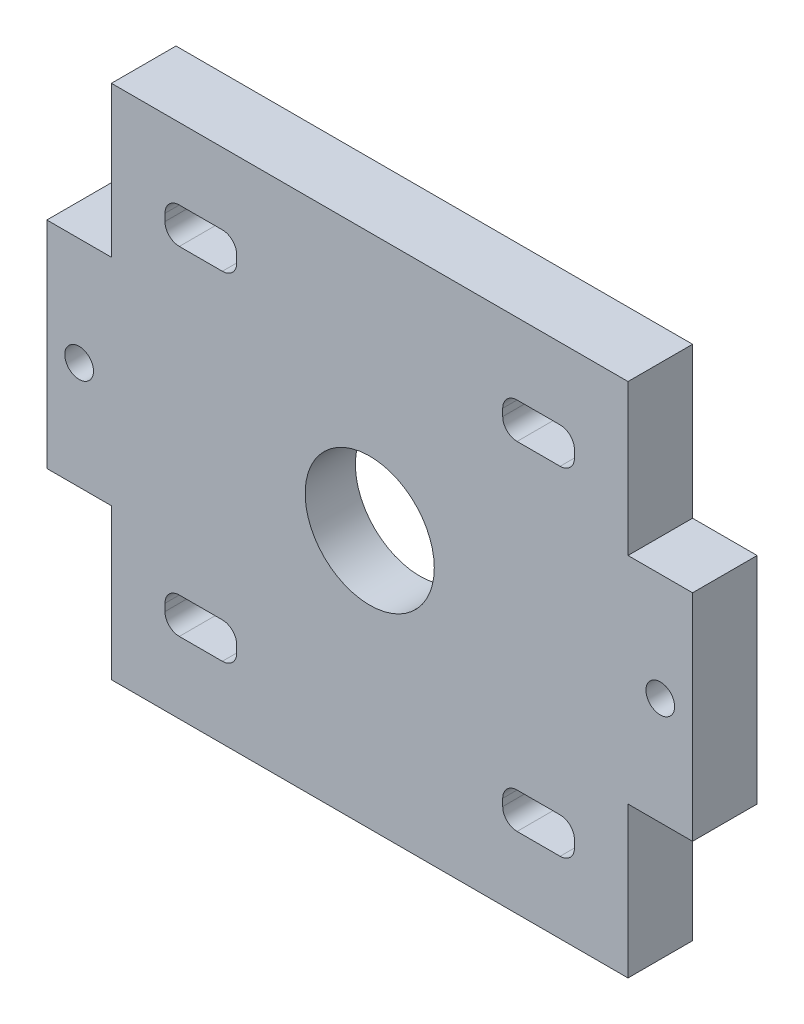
ISO-10303-21;
HEADER;
FILE_DESCRIPTION(('STEP AP214'),'2;1');
FILE_NAME('part.step','',(''),(''),'','','');
FILE_SCHEMA(('AUTOMOTIVE_DESIGN { 1 0 10303 214 1 1 1 1 }'));
ENDSEC;
DATA;
#1=APPLICATION_CONTEXT('core data for automotive mechanical design processes');
#2=APPLICATION_PROTOCOL_DEFINITION('international standard','automotive_design',2000,#1);
#3=PRODUCT_CONTEXT('',#1,'mechanical');
#4=PRODUCT('Part','Part','',(#3));
#5=PRODUCT_RELATED_PRODUCT_CATEGORY('part','',(#4));
#6=PRODUCT_DEFINITION_FORMATION('','',#4);
#7=PRODUCT_DEFINITION_CONTEXT('part definition',#1,'design');
#8=PRODUCT_DEFINITION('design','',#6,#7);
#9=PRODUCT_DEFINITION_SHAPE('','',#8);
#10=(LENGTH_UNIT() NAMED_UNIT(*) SI_UNIT(.MILLI.,.METRE.));
#11=(NAMED_UNIT(*) PLANE_ANGLE_UNIT() SI_UNIT($,.RADIAN.));
#12=(NAMED_UNIT(*) SI_UNIT($,.STERADIAN.) SOLID_ANGLE_UNIT());
#13=UNCERTAINTY_MEASURE_WITH_UNIT(LENGTH_MEASURE(1.E-05),#10,'distance_accuracy_value','');
#14=(GEOMETRIC_REPRESENTATION_CONTEXT(3) GLOBAL_UNCERTAINTY_ASSIGNED_CONTEXT((#13)) GLOBAL_UNIT_ASSIGNED_CONTEXT((#10,
#11,#12)) REPRESENTATION_CONTEXT('',''));
#15=CARTESIAN_POINT('',(0.,0.,0.));
#16=DIRECTION('',(0.,0.,1.));
#17=DIRECTION('',(1.,0.,0.));
#18=AXIS2_PLACEMENT_3D('',#15,#16,#17);
#19=CARTESIAN_POINT('',(0.,0.,9.));
#20=DIRECTION('',(0.,0.,-1.));
#21=DIRECTION('',(-1.,0.,0.));
#22=AXIS2_PLACEMENT_3D('',#19,#20,#21);
#23=PLANE('',#22);
#24=CARTESIAN_POINT('',(27.0030507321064,133.166228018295,9.));
#25=DIRECTION('',(0.,0.,-1.));
#26=DIRECTION('',(-1.,0.,0.));
#27=AXIS2_PLACEMENT_3D('',#24,#25,#26);
#28=CIRCLE('',#27,2.);
#29=CARTESIAN_POINT('',(25.0030507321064,133.166228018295,9.));
#30=VERTEX_POINT('',#29);
#31=EDGE_CURVE('E1478',#30,#30,#28,.T.);
#32=ORIENTED_EDGE('',*,*,#31,.T.);
#33=EDGE_LOOP('',(#32));
#34=FACE_BOUND('',#33,.T.);
#35=CARTESIAN_POINT('',(-53.9969492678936,133.166228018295,9.));
#36=DIRECTION('',(0.,0.,-1.));
#37=DIRECTION('',(-1.,0.,0.));
#38=AXIS2_PLACEMENT_3D('',#35,#36,#37);
#39=CIRCLE('',#38,2.);
#40=CARTESIAN_POINT('',(-55.9969492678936,133.166228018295,9.));
#41=VERTEX_POINT('',#40);
#42=EDGE_CURVE('E1482',#41,#41,#39,.F.);
#43=ORIENTED_EDGE('',*,*,#42,.F.);
#44=EDGE_LOOP('',(#43));
#45=FACE_BOUND('',#44,.T.);
#46=CARTESIAN_POINT('',(13.0416329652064,156.204810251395,9.));
#47=DIRECTION('',(0.,0.,1.));
#48=DIRECTION('',(1.,0.,0.));
#49=AXIS2_PLACEMENT_3D('',#46,#47,#48);
#50=CIRCLE('',#49,2.);
#51=CARTESIAN_POINT('',(13.0416329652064,154.204810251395,9.));
#52=VERTEX_POINT('',#51);
#53=CARTESIAN_POINT('',(15.0416329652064,156.204810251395,9.));
#54=VERTEX_POINT('',#53);
#55=EDGE_CURVE('E725',#52,#54,#50,.T.);
#56=ORIENTED_EDGE('',*,*,#55,.F.);
#57=DIRECTION('',(-1.,0.,0.));
#58=VECTOR('',#57,1.);
#59=CARTESIAN_POINT('',(13.0416329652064,154.204810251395,9.));
#60=LINE('',#59,#58);
#61=CARTESIAN_POINT('',(7.04163296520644,154.204810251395,9.));
#62=VERTEX_POINT('',#61);
#63=EDGE_CURVE('E743',#52,#62,#60,.T.);
#64=ORIENTED_EDGE('',*,*,#63,.T.);
#65=CARTESIAN_POINT('',(7.04163296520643,156.204810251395,9.));
#66=DIRECTION('',(0.,0.,-1.));
#67=DIRECTION('',(-1.,0.,0.));
#68=AXIS2_PLACEMENT_3D('',#65,#66,#67);
#69=CIRCLE('',#68,2.);
#70=CARTESIAN_POINT('',(5.04163296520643,156.204810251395,9.));
#71=VERTEX_POINT('',#70);
#72=EDGE_CURVE('E740',#62,#71,#69,.T.);
#73=ORIENTED_EDGE('',*,*,#72,.T.);
#74=DIRECTION('',(0.,-1.,0.));
#75=VECTOR('',#74,1.);
#76=CARTESIAN_POINT('',(5.04163296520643,157.204810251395,9.));
#77=LINE('',#76,#75);
#78=CARTESIAN_POINT('',(5.04163296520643,157.204810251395,9.));
#79=VERTEX_POINT('',#78);
#80=EDGE_CURVE('E738',#79,#71,#77,.T.);
#81=ORIENTED_EDGE('',*,*,#80,.F.);
#82=CARTESIAN_POINT('',(7.04163296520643,157.204810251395,9.));
#83=DIRECTION('',(0.,0.,1.));
#84=DIRECTION('',(1.,0.,0.));
#85=AXIS2_PLACEMENT_3D('',#82,#83,#84);
#86=CIRCLE('',#85,2.);
#87=CARTESIAN_POINT('',(7.04163296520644,159.204810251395,9.));
#88=VERTEX_POINT('',#87);
#89=EDGE_CURVE('E736',#88,#79,#86,.T.);
#90=ORIENTED_EDGE('',*,*,#89,.F.);
#91=DIRECTION('',(-1.,0.,0.));
#92=VECTOR('',#91,1.);
#93=CARTESIAN_POINT('',(13.0416329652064,159.204810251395,9.));
#94=LINE('',#93,#92);
#95=CARTESIAN_POINT('',(13.0416329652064,159.204810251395,9.));
#96=VERTEX_POINT('',#95);
#97=EDGE_CURVE('E734',#96,#88,#94,.T.);
#98=ORIENTED_EDGE('',*,*,#97,.F.);
#99=CARTESIAN_POINT('',(13.0416329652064,157.204810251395,9.));
#100=DIRECTION('',(0.,0.,-1.));
#101=DIRECTION('',(-1.,0.,0.));
#102=AXIS2_PLACEMENT_3D('',#99,#100,#101);
#103=CIRCLE('',#102,2.);
#104=CARTESIAN_POINT('',(15.0416329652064,157.204810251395,9.));
#105=VERTEX_POINT('',#104);
#106=EDGE_CURVE('E731',#96,#105,#103,.T.);
#107=ORIENTED_EDGE('',*,*,#106,.T.);
#108=DIRECTION('',(0.,-1.,0.));
#109=VECTOR('',#108,1.);
#110=CARTESIAN_POINT('',(15.0416329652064,157.204810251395,9.));
#111=LINE('',#110,#109);
#112=EDGE_CURVE('E727',#105,#54,#111,.T.);
#113=ORIENTED_EDGE('',*,*,#112,.T.);
#114=EDGE_LOOP('',(#56,#64,#73,#81,#90,#98,#107,#113));
#115=FACE_BOUND('',#114,.T.);
#116=DIRECTION('',(1.,0.,0.));
#117=VECTOR('',#116,1.);
#118=CARTESIAN_POINT('',(-40.0355315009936,154.204810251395,9.));
#119=LINE('',#118,#117);
#120=CARTESIAN_POINT('',(-40.0355315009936,154.204810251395,9.));
#121=VERTEX_POINT('',#120);
#122=CARTESIAN_POINT('',(-34.0355315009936,154.204810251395,9.));
#123=VERTEX_POINT('',#122);
#124=EDGE_CURVE('E806',#121,#123,#119,.T.);
#125=ORIENTED_EDGE('',*,*,#124,.F.);
#126=CARTESIAN_POINT('',(-40.0355315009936,156.204810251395,9.));
#127=DIRECTION('',(0.,0.,-1.));
#128=DIRECTION('',(-1.,0.,0.));
#129=AXIS2_PLACEMENT_3D('',#126,#127,#128);
#130=CIRCLE('',#129,2.);
#131=CARTESIAN_POINT('',(-42.0355315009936,156.204810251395,9.));
#132=VERTEX_POINT('',#131);
#133=EDGE_CURVE('E786',#121,#132,#130,.T.);
#134=ORIENTED_EDGE('',*,*,#133,.T.);
#135=DIRECTION('',(0.,-1.,0.));
#136=VECTOR('',#135,1.);
#137=CARTESIAN_POINT('',(-42.0355315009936,157.204810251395,9.));
#138=LINE('',#137,#136);
#139=CARTESIAN_POINT('',(-42.0355315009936,157.204810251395,9.));
#140=VERTEX_POINT('',#139);
#141=EDGE_CURVE('E789',#140,#132,#138,.T.);
#142=ORIENTED_EDGE('',*,*,#141,.F.);
#143=CARTESIAN_POINT('',(-40.0355315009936,157.204810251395,9.));
#144=DIRECTION('',(0.,0.,1.));
#145=DIRECTION('',(1.,0.,0.));
#146=AXIS2_PLACEMENT_3D('',#143,#144,#145);
#147=CIRCLE('',#146,2.);
#148=CARTESIAN_POINT('',(-40.0355315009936,159.204810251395,9.));
#149=VERTEX_POINT('',#148);
#150=EDGE_CURVE('E792',#149,#140,#147,.T.);
#151=ORIENTED_EDGE('',*,*,#150,.F.);
#152=DIRECTION('',(1.,0.,0.));
#153=VECTOR('',#152,1.);
#154=CARTESIAN_POINT('',(-40.0355315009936,159.204810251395,9.));
#155=LINE('',#154,#153);
#156=CARTESIAN_POINT('',(-34.0355315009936,159.204810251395,9.));
#157=VERTEX_POINT('',#156);
#158=EDGE_CURVE('E795',#149,#157,#155,.T.);
#159=ORIENTED_EDGE('',*,*,#158,.T.);
#160=CARTESIAN_POINT('',(-34.0355315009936,157.204810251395,9.));
#161=DIRECTION('',(0.,0.,-1.));
#162=DIRECTION('',(-1.,0.,0.));
#163=AXIS2_PLACEMENT_3D('',#160,#161,#162);
#164=CIRCLE('',#163,2.);
#165=CARTESIAN_POINT('',(-32.0355315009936,157.204810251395,9.));
#166=VERTEX_POINT('',#165);
#167=EDGE_CURVE('E798',#157,#166,#164,.T.);
#168=ORIENTED_EDGE('',*,*,#167,.T.);
#169=DIRECTION('',(0.,-1.,0.));
#170=VECTOR('',#169,1.);
#171=CARTESIAN_POINT('',(-32.0355315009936,157.204810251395,9.));
#172=LINE('',#171,#170);
#173=CARTESIAN_POINT('',(-32.0355315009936,156.204810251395,9.));
#174=VERTEX_POINT('',#173);
#175=EDGE_CURVE('E801',#166,#174,#172,.T.);
#176=ORIENTED_EDGE('',*,*,#175,.T.);
#177=CARTESIAN_POINT('',(-34.0355315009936,156.204810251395,9.));
#178=DIRECTION('',(0.,0.,1.));
#179=DIRECTION('',(1.,0.,0.));
#180=AXIS2_PLACEMENT_3D('',#177,#178,#179);
#181=CIRCLE('',#180,2.);
#182=EDGE_CURVE('E804',#123,#174,#181,.T.);
#183=ORIENTED_EDGE('',*,*,#182,.F.);
#184=EDGE_LOOP('',(#125,#134,#142,#151,#159,#168,#176,#183));
#185=FACE_BOUND('',#184,.T.);
#186=DIRECTION('',(-1.,0.,0.));
#187=VECTOR('',#186,1.);
#188=CARTESIAN_POINT('',(31.5030507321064,148.166228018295,9.));
#189=LINE('',#188,#187);
#190=CARTESIAN_POINT('',(31.5030507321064,148.166228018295,9.));
#191=VERTEX_POINT('',#190);
#192=CARTESIAN_POINT('',(22.5030507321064,148.166228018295,9.));
#193=VERTEX_POINT('',#192);
#194=EDGE_CURVE('E850',#191,#193,#189,.T.);
#195=ORIENTED_EDGE('',*,*,#194,.T.);
#196=DIRECTION('',(0.,1.,0.));
#197=VECTOR('',#196,1.);
#198=CARTESIAN_POINT('',(22.5030507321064,148.166228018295,9.));
#199=LINE('',#198,#197);
#200=CARTESIAN_POINT('',(22.5030507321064,169.166228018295,9.));
#201=VERTEX_POINT('',#200);
#202=EDGE_CURVE('E853',#193,#201,#199,.T.);
#203=ORIENTED_EDGE('',*,*,#202,.T.);
#204=DIRECTION('',(1.,0.,0.));
#205=VECTOR('',#204,1.);
#206=CARTESIAN_POINT('',(-49.4969492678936,169.166228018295,9.));
#207=LINE('',#206,#205);
#208=CARTESIAN_POINT('',(-49.4969492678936,169.166228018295,9.));
#209=VERTEX_POINT('',#208);
#210=EDGE_CURVE('E856',#209,#201,#207,.T.);
#211=ORIENTED_EDGE('',*,*,#210,.F.);
#212=DIRECTION('',(0.,1.,0.));
#213=VECTOR('',#212,1.);
#214=CARTESIAN_POINT('',(-49.4969492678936,148.166228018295,9.));
#215=LINE('',#214,#213);
#216=CARTESIAN_POINT('',(-49.4969492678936,148.166228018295,9.));
#217=VERTEX_POINT('',#216);
#218=EDGE_CURVE('E859',#217,#209,#215,.T.);
#219=ORIENTED_EDGE('',*,*,#218,.F.);
#220=DIRECTION('',(1.,0.,0.));
#221=VECTOR('',#220,1.);
#222=CARTESIAN_POINT('',(-58.4969492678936,148.166228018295,9.));
#223=LINE('',#222,#221);
#224=CARTESIAN_POINT('',(-58.4969492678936,148.166228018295,9.));
#225=VERTEX_POINT('',#224);
#226=EDGE_CURVE('E862',#225,#217,#223,.T.);
#227=ORIENTED_EDGE('',*,*,#226,.F.);
#228=DIRECTION('',(0.,1.,0.));
#229=VECTOR('',#228,1.);
#230=CARTESIAN_POINT('',(-58.4969492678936,118.166228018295,9.));
#231=LINE('',#230,#229);
#232=CARTESIAN_POINT('',(-58.4969492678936,118.166228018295,9.));
#233=VERTEX_POINT('',#232);
#234=EDGE_CURVE('E865',#233,#225,#231,.T.);
#235=ORIENTED_EDGE('',*,*,#234,.F.);
#236=DIRECTION('',(-1.,0.,0.));
#237=VECTOR('',#236,1.);
#238=CARTESIAN_POINT('',(-49.4969492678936,118.166228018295,9.));
#239=LINE('',#238,#237);
#240=CARTESIAN_POINT('',(-49.4969492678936,118.166228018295,9.));
#241=VERTEX_POINT('',#240);
#242=EDGE_CURVE('E868',#241,#233,#239,.T.);
#243=ORIENTED_EDGE('',*,*,#242,.F.);
#244=DIRECTION('',(0.,1.,0.));
#245=VECTOR('',#244,1.);
#246=CARTESIAN_POINT('',(-49.4969492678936,97.1662280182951,9.));
#247=LINE('',#246,#245);
#248=CARTESIAN_POINT('',(-49.4969492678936,97.1662280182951,9.));
#249=VERTEX_POINT('',#248);
#250=EDGE_CURVE('E871',#249,#241,#247,.T.);
#251=ORIENTED_EDGE('',*,*,#250,.F.);
#252=DIRECTION('',(1.,0.,0.));
#253=VECTOR('',#252,1.);
#254=CARTESIAN_POINT('',(-49.4969492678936,97.1662280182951,9.));
#255=LINE('',#254,#253);
#256=CARTESIAN_POINT('',(22.5030507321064,97.1662280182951,9.));
#257=VERTEX_POINT('',#256);
#258=EDGE_CURVE('E874',#249,#257,#255,.T.);
#259=ORIENTED_EDGE('',*,*,#258,.T.);
#260=DIRECTION('',(0.,1.,0.));
#261=VECTOR('',#260,1.);
#262=CARTESIAN_POINT('',(22.5030507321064,97.1662280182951,9.));
#263=LINE('',#262,#261);
#264=CARTESIAN_POINT('',(22.5030507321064,118.166228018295,9.));
#265=VERTEX_POINT('',#264);
#266=EDGE_CURVE('E876',#257,#265,#263,.T.);
#267=ORIENTED_EDGE('',*,*,#266,.T.);
#268=DIRECTION('',(1.,0.,0.));
#269=VECTOR('',#268,1.);
#270=CARTESIAN_POINT('',(22.5030507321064,118.166228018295,9.));
#271=LINE('',#270,#269);
#272=CARTESIAN_POINT('',(31.5030507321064,118.166228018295,9.));
#273=VERTEX_POINT('',#272);
#274=EDGE_CURVE('E878',#265,#273,#271,.T.);
#275=ORIENTED_EDGE('',*,*,#274,.T.);
#276=DIRECTION('',(0.,1.,0.));
#277=VECTOR('',#276,1.);
#278=CARTESIAN_POINT('',(31.5030507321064,118.166228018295,9.));
#279=LINE('',#278,#277);
#280=EDGE_CURVE('E880',#273,#191,#279,.T.);
#281=ORIENTED_EDGE('',*,*,#280,.T.);
#282=EDGE_LOOP('',(#195,#203,#211,#219,#227,#235,#243,#251,#259,#267,#275,#281));
#283=FACE_BOUND('',#282,.T.);
#284=CARTESIAN_POINT('',(-13.4969492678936,133.166228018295,9.));
#285=DIRECTION('',(0.,0.,1.));
#286=DIRECTION('',(1.,0.,0.));
#287=AXIS2_PLACEMENT_3D('',#284,#285,#286);
#288=CIRCLE('',#287,9.);
#289=CARTESIAN_POINT('',(-4.49694926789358,133.166228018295,9.));
#290=VERTEX_POINT('',#289);
#291=EDGE_CURVE('E832',#290,#290,#288,.T.);
#292=ORIENTED_EDGE('',*,*,#291,.F.);
#293=EDGE_LOOP('',(#292));
#294=FACE_BOUND('',#293,.T.);
#295=DIRECTION('',(-1.,0.,0.));
#296=VECTOR('',#295,1.);
#297=CARTESIAN_POINT('',(13.0416329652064,112.127645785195,9.));
#298=LINE('',#297,#296);
#299=CARTESIAN_POINT('',(13.0416329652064,112.127645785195,9.));
#300=VERTEX_POINT('',#299);
#301=CARTESIAN_POINT('',(7.04163296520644,112.127645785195,9.));
#302=VERTEX_POINT('',#301);
#303=EDGE_CURVE('E684',#300,#302,#298,.T.);
#304=ORIENTED_EDGE('',*,*,#303,.F.);
#305=CARTESIAN_POINT('',(13.0416329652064,110.127645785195,9.));
#306=DIRECTION('',(0.,0.,-1.));
#307=DIRECTION('',(-1.,0.,0.));
#308=AXIS2_PLACEMENT_3D('',#305,#306,#307);
#309=CIRCLE('',#308,2.);
#310=CARTESIAN_POINT('',(15.0416329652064,110.127645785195,9.));
#311=VERTEX_POINT('',#310);
#312=EDGE_CURVE('E664',#300,#311,#309,.T.);
#313=ORIENTED_EDGE('',*,*,#312,.T.);
#314=DIRECTION('',(0.,1.,0.));
#315=VECTOR('',#314,1.);
#316=CARTESIAN_POINT('',(15.0416329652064,109.127645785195,9.));
#317=LINE('',#316,#315);
#318=CARTESIAN_POINT('',(15.0416329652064,109.127645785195,9.));
#319=VERTEX_POINT('',#318);
#320=EDGE_CURVE('E667',#319,#311,#317,.T.);
#321=ORIENTED_EDGE('',*,*,#320,.F.);
#322=CARTESIAN_POINT('',(13.0416329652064,109.127645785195,9.));
#323=DIRECTION('',(0.,0.,1.));
#324=DIRECTION('',(1.,0.,0.));
#325=AXIS2_PLACEMENT_3D('',#322,#323,#324);
#326=CIRCLE('',#325,2.);
#327=CARTESIAN_POINT('',(13.0416329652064,107.127645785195,9.));
#328=VERTEX_POINT('',#327);
#329=EDGE_CURVE('E670',#328,#319,#326,.T.);
#330=ORIENTED_EDGE('',*,*,#329,.F.);
#331=DIRECTION('',(-1.,0.,0.));
#332=VECTOR('',#331,1.);
#333=CARTESIAN_POINT('',(13.0416329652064,107.127645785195,9.));
#334=LINE('',#333,#332);
#335=CARTESIAN_POINT('',(7.04163296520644,107.127645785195,9.));
#336=VERTEX_POINT('',#335);
#337=EDGE_CURVE('E673',#328,#336,#334,.T.);
#338=ORIENTED_EDGE('',*,*,#337,.T.);
#339=CARTESIAN_POINT('',(7.04163296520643,109.127645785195,9.));
#340=DIRECTION('',(0.,0.,-1.));
#341=DIRECTION('',(-1.,0.,0.));
#342=AXIS2_PLACEMENT_3D('',#339,#340,#341);
#343=CIRCLE('',#342,2.);
#344=CARTESIAN_POINT('',(5.04163296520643,109.127645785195,9.));
#345=VERTEX_POINT('',#344);
#346=EDGE_CURVE('E676',#336,#345,#343,.T.);
#347=ORIENTED_EDGE('',*,*,#346,.T.);
#348=DIRECTION('',(0.,1.,0.));
#349=VECTOR('',#348,1.);
#350=CARTESIAN_POINT('',(5.04163296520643,109.127645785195,9.));
#351=LINE('',#350,#349);
#352=CARTESIAN_POINT('',(5.04163296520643,110.127645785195,9.));
#353=VERTEX_POINT('',#352);
#354=EDGE_CURVE('E679',#345,#353,#351,.T.);
#355=ORIENTED_EDGE('',*,*,#354,.T.);
#356=CARTESIAN_POINT('',(7.04163296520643,110.127645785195,9.));
#357=DIRECTION('',(0.,0.,1.));
#358=DIRECTION('',(1.,0.,0.));
#359=AXIS2_PLACEMENT_3D('',#356,#357,#358);
#360=CIRCLE('',#359,2.);
#361=EDGE_CURVE('E682',#302,#353,#360,.T.);
#362=ORIENTED_EDGE('',*,*,#361,.F.);
#363=EDGE_LOOP('',(#304,#313,#321,#330,#338,#347,#355,#362));
#364=FACE_BOUND('',#363,.T.);
#365=CARTESIAN_POINT('',(-40.0355315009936,110.127645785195,9.));
#366=DIRECTION('',(0.,0.,1.));
#367=DIRECTION('',(1.,0.,0.));
#368=AXIS2_PLACEMENT_3D('',#365,#366,#367);
#369=CIRCLE('',#368,2.);
#370=CARTESIAN_POINT('',(-40.0355315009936,112.127645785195,9.));
#371=VERTEX_POINT('',#370);
#372=CARTESIAN_POINT('',(-42.0355315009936,110.127645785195,9.));
#373=VERTEX_POINT('',#372);
#374=EDGE_CURVE('E594',#371,#373,#369,.T.);
#375=ORIENTED_EDGE('',*,*,#374,.F.);
#376=DIRECTION('',(1.,0.,0.));
#377=VECTOR('',#376,1.);
#378=CARTESIAN_POINT('',(-40.0355315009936,112.127645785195,9.));
#379=LINE('',#378,#377);
#380=CARTESIAN_POINT('',(-34.0355315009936,112.127645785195,9.));
#381=VERTEX_POINT('',#380);
#382=EDGE_CURVE('E630',#371,#381,#379,.T.);
#383=ORIENTED_EDGE('',*,*,#382,.T.);
#384=CARTESIAN_POINT('',(-34.0355315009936,110.127645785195,9.));
#385=DIRECTION('',(0.,0.,-1.));
#386=DIRECTION('',(-1.,0.,0.));
#387=AXIS2_PLACEMENT_3D('',#384,#385,#386);
#388=CIRCLE('',#387,2.);
#389=CARTESIAN_POINT('',(-32.0355315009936,110.127645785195,9.));
#390=VERTEX_POINT('',#389);
#391=EDGE_CURVE('E329',#381,#390,#388,.T.);
#392=ORIENTED_EDGE('',*,*,#391,.T.);
#393=DIRECTION('',(0.,1.,0.));
#394=VECTOR('',#393,1.);
#395=CARTESIAN_POINT('',(-32.0355315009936,109.127645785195,9.));
#396=LINE('',#395,#394);
#397=CARTESIAN_POINT('',(-32.0355315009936,109.127645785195,9.));
#398=VERTEX_POINT('',#397);
#399=EDGE_CURVE('E627',#398,#390,#396,.T.);
#400=ORIENTED_EDGE('',*,*,#399,.F.);
#401=CARTESIAN_POINT('',(-34.0355315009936,109.127645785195,9.));
#402=DIRECTION('',(0.,0.,1.));
#403=DIRECTION('',(1.,0.,0.));
#404=AXIS2_PLACEMENT_3D('',#401,#402,#403);
#405=CIRCLE('',#404,2.);
#406=CARTESIAN_POINT('',(-34.0355315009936,107.127645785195,9.));
#407=VERTEX_POINT('',#406);
#408=EDGE_CURVE('E625',#407,#398,#405,.T.);
#409=ORIENTED_EDGE('',*,*,#408,.F.);
#410=DIRECTION('',(1.,0.,0.));
#411=VECTOR('',#410,1.);
#412=CARTESIAN_POINT('',(-40.0355315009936,107.127645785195,9.));
#413=LINE('',#412,#411);
#414=CARTESIAN_POINT('',(-40.0355315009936,107.127645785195,9.));
#415=VERTEX_POINT('',#414);
#416=EDGE_CURVE('E620',#415,#407,#413,.T.);
#417=ORIENTED_EDGE('',*,*,#416,.F.);
#418=CARTESIAN_POINT('',(-40.0355315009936,109.127645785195,9.));
#419=DIRECTION('',(0.,0.,-1.));
#420=DIRECTION('',(-1.,0.,0.));
#421=AXIS2_PLACEMENT_3D('',#418,#419,#420);
#422=CIRCLE('',#421,2.);
#423=CARTESIAN_POINT('',(-42.0355315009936,109.127645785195,9.));
#424=VERTEX_POINT('',#423);
#425=EDGE_CURVE('E618',#415,#424,#422,.T.);
#426=ORIENTED_EDGE('',*,*,#425,.T.);
#427=DIRECTION('',(0.,1.,0.));
#428=VECTOR('',#427,1.);
#429=CARTESIAN_POINT('',(-42.0355315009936,109.127645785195,9.));
#430=LINE('',#429,#428);
#431=EDGE_CURVE('E604',#424,#373,#430,.T.);
#432=ORIENTED_EDGE('',*,*,#431,.T.);
#433=EDGE_LOOP('',(#375,#383,#392,#400,#409,#417,#426,#432));
#434=FACE_BOUND('',#433,.T.);
#435=ADVANCED_FACE('F314',(#34,#45,#115,#185,#283,#294,#364,#434),#23,.F.);
#436=CARTESIAN_POINT('',(0.,0.,0.));
#437=DIRECTION('',(0.,0.,-1.));
#438=DIRECTION('',(-1.,0.,0.));
#439=AXIS2_PLACEMENT_3D('',#436,#437,#438);
#440=PLANE('',#439);
#441=CARTESIAN_POINT('',(27.0030507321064,133.166228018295,0.));
#442=DIRECTION('',(0.,0.,-1.));
#443=DIRECTION('',(-1.,0.,0.));
#444=AXIS2_PLACEMENT_3D('',#441,#442,#443);
#445=CIRCLE('',#444,2.);
#446=CARTESIAN_POINT('',(25.0030507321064,133.166228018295,0.));
#447=VERTEX_POINT('',#446);
#448=EDGE_CURVE('E1476',#447,#447,#445,.T.);
#449=ORIENTED_EDGE('',*,*,#448,.F.);
#450=EDGE_LOOP('',(#449));
#451=FACE_BOUND('',#450,.T.);
#452=CARTESIAN_POINT('',(-53.9969492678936,133.166228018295,0.));
#453=DIRECTION('',(0.,0.,1.));
#454=DIRECTION('',(1.,0.,0.));
#455=AXIS2_PLACEMENT_3D('',#452,#453,#454);
#456=CIRCLE('',#455,2.);
#457=CARTESIAN_POINT('',(-51.9969492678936,133.166228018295,0.));
#458=VERTEX_POINT('',#457);
#459=EDGE_CURVE('E1479',#458,#458,#456,.T.);
#460=ORIENTED_EDGE('',*,*,#459,.T.);
#461=EDGE_LOOP('',(#460));
#462=FACE_BOUND('',#461,.T.);
#463=CARTESIAN_POINT('',(-13.4969492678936,133.166228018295,0.));
#464=DIRECTION('',(0.,0.,1.));
#465=DIRECTION('',(1.,0.,0.));
#466=AXIS2_PLACEMENT_3D('',#463,#464,#465);
#467=CIRCLE('',#466,18.65);
#468=CARTESIAN_POINT('',(5.15305073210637,133.166228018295,0.));
#469=VERTEX_POINT('',#468);
#470=EDGE_CURVE('E1488',#469,#469,#467,.T.);
#471=ORIENTED_EDGE('',*,*,#470,.T.);
#472=EDGE_LOOP('',(#471));
#473=FACE_BOUND('',#472,.T.);
#474=CARTESIAN_POINT('',(13.0416329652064,110.127645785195,0.));
#475=DIRECTION('',(0.,0.,-1.));
#476=DIRECTION('',(-1.,0.,0.));
#477=AXIS2_PLACEMENT_3D('',#474,#475,#476);
#478=CIRCLE('',#477,2.);
#479=CARTESIAN_POINT('',(13.0416329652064,112.127645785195,0.));
#480=VERTEX_POINT('',#479);
#481=CARTESIAN_POINT('',(15.0416329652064,110.127645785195,0.));
#482=VERTEX_POINT('',#481);
#483=EDGE_CURVE('E613',#480,#482,#478,.T.);
#484=ORIENTED_EDGE('',*,*,#483,.F.);
#485=DIRECTION('',(-1.,0.,0.));
#486=VECTOR('',#485,1.);
#487=CARTESIAN_POINT('',(13.0416329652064,112.127645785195,0.));
#488=LINE('',#487,#486);
#489=CARTESIAN_POINT('',(7.04163296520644,112.127645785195,0.));
#490=VERTEX_POINT('',#489);
#491=EDGE_CURVE('E668',#480,#490,#488,.T.);
#492=ORIENTED_EDGE('',*,*,#491,.T.);
#493=CARTESIAN_POINT('',(7.04163296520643,110.127645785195,0.));
#494=DIRECTION('',(0.,0.,1.));
#495=DIRECTION('',(1.,0.,0.));
#496=AXIS2_PLACEMENT_3D('',#493,#494,#495);
#497=CIRCLE('',#496,2.);
#498=CARTESIAN_POINT('',(5.04163296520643,110.127645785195,0.));
#499=VERTEX_POINT('',#498);
#500=EDGE_CURVE('E703',#490,#499,#497,.T.);
#501=ORIENTED_EDGE('',*,*,#500,.T.);
#502=DIRECTION('',(0.,1.,0.));
#503=VECTOR('',#502,1.);
#504=CARTESIAN_POINT('',(5.04163296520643,109.127645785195,0.));
#505=LINE('',#504,#503);
#506=CARTESIAN_POINT('',(5.04163296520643,109.127645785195,0.));
#507=VERTEX_POINT('',#506);
#508=EDGE_CURVE('E700',#507,#499,#505,.T.);
#509=ORIENTED_EDGE('',*,*,#508,.F.);
#510=CARTESIAN_POINT('',(7.04163296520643,109.127645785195,0.));
#511=DIRECTION('',(0.,0.,-1.));
#512=DIRECTION('',(-1.,0.,0.));
#513=AXIS2_PLACEMENT_3D('',#510,#511,#512);
#514=CIRCLE('',#513,2.);
#515=CARTESIAN_POINT('',(7.04163296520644,107.127645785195,0.));
#516=VERTEX_POINT('',#515);
#517=EDGE_CURVE('E697',#516,#507,#514,.T.);
#518=ORIENTED_EDGE('',*,*,#517,.F.);
#519=DIRECTION('',(-1.,0.,0.));
#520=VECTOR('',#519,1.);
#521=CARTESIAN_POINT('',(13.0416329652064,107.127645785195,0.));
#522=LINE('',#521,#520);
#523=CARTESIAN_POINT('',(13.0416329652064,107.127645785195,0.));
#524=VERTEX_POINT('',#523);
#525=EDGE_CURVE('E694',#524,#516,#522,.T.);
#526=ORIENTED_EDGE('',*,*,#525,.F.);
#527=CARTESIAN_POINT('',(13.0416329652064,109.127645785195,0.));
#528=DIRECTION('',(0.,0.,1.));
#529=DIRECTION('',(1.,0.,0.));
#530=AXIS2_PLACEMENT_3D('',#527,#528,#529);
#531=CIRCLE('',#530,2.);
#532=CARTESIAN_POINT('',(15.0416329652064,109.127645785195,0.));
#533=VERTEX_POINT('',#532);
#534=EDGE_CURVE('E691',#524,#533,#531,.T.);
#535=ORIENTED_EDGE('',*,*,#534,.T.);
#536=DIRECTION('',(0.,1.,0.));
#537=VECTOR('',#536,1.);
#538=CARTESIAN_POINT('',(15.0416329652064,109.127645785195,0.));
#539=LINE('',#538,#537);
#540=EDGE_CURVE('E688',#533,#482,#539,.T.);
#541=ORIENTED_EDGE('',*,*,#540,.T.);
#542=EDGE_LOOP('',(#484,#492,#501,#509,#518,#526,#535,#541));
#543=FACE_BOUND('',#542,.T.);
#544=CARTESIAN_POINT('',(-40.0355315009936,156.204810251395,0.));
#545=DIRECTION('',(0.,0.,-1.));
#546=DIRECTION('',(-1.,0.,0.));
#547=AXIS2_PLACEMENT_3D('',#544,#545,#546);
#548=CIRCLE('',#547,2.);
#549=CARTESIAN_POINT('',(-40.0355315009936,154.204810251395,0.));
#550=VERTEX_POINT('',#549);
#551=CARTESIAN_POINT('',(-42.0355315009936,156.204810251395,0.));
#552=VERTEX_POINT('',#551);
#553=EDGE_CURVE('E785',#550,#552,#548,.T.);
#554=ORIENTED_EDGE('',*,*,#553,.F.);
#555=DIRECTION('',(1.,0.,0.));
#556=VECTOR('',#555,1.);
#557=CARTESIAN_POINT('',(-40.0355315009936,154.204810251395,0.));
#558=LINE('',#557,#556);
#559=CARTESIAN_POINT('',(-34.0355315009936,154.204810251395,0.));
#560=VERTEX_POINT('',#559);
#561=EDGE_CURVE('E790',#550,#560,#558,.T.);
#562=ORIENTED_EDGE('',*,*,#561,.T.);
#563=CARTESIAN_POINT('',(-34.0355315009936,156.204810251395,0.));
#564=DIRECTION('',(0.,0.,1.));
#565=DIRECTION('',(1.,0.,0.));
#566=AXIS2_PLACEMENT_3D('',#563,#564,#565);
#567=CIRCLE('',#566,2.);
#568=CARTESIAN_POINT('',(-32.0355315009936,156.204810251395,0.));
#569=VERTEX_POINT('',#568);
#570=EDGE_CURVE('E825',#560,#569,#567,.T.);
#571=ORIENTED_EDGE('',*,*,#570,.T.);
#572=DIRECTION('',(0.,-1.,0.));
#573=VECTOR('',#572,1.);
#574=CARTESIAN_POINT('',(-32.0355315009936,157.204810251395,0.));
#575=LINE('',#574,#573);
#576=CARTESIAN_POINT('',(-32.0355315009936,157.204810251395,0.));
#577=VERTEX_POINT('',#576);
#578=EDGE_CURVE('E822',#577,#569,#575,.T.);
#579=ORIENTED_EDGE('',*,*,#578,.F.);
#580=CARTESIAN_POINT('',(-34.0355315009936,157.204810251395,0.));
#581=DIRECTION('',(0.,0.,-1.));
#582=DIRECTION('',(-1.,0.,0.));
#583=AXIS2_PLACEMENT_3D('',#580,#581,#582);
#584=CIRCLE('',#583,2.);
#585=CARTESIAN_POINT('',(-34.0355315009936,159.204810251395,0.));
#586=VERTEX_POINT('',#585);
#587=EDGE_CURVE('E819',#586,#577,#584,.T.);
#588=ORIENTED_EDGE('',*,*,#587,.F.);
#589=DIRECTION('',(1.,0.,0.));
#590=VECTOR('',#589,1.);
#591=CARTESIAN_POINT('',(-40.0355315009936,159.204810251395,0.));
#592=LINE('',#591,#590);
#593=CARTESIAN_POINT('',(-40.0355315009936,159.204810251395,0.));
#594=VERTEX_POINT('',#593);
#595=EDGE_CURVE('E816',#594,#586,#592,.T.);
#596=ORIENTED_EDGE('',*,*,#595,.F.);
#597=CARTESIAN_POINT('',(-40.0355315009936,157.204810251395,0.));
#598=DIRECTION('',(0.,0.,1.));
#599=DIRECTION('',(1.,0.,0.));
#600=AXIS2_PLACEMENT_3D('',#597,#598,#599);
#601=CIRCLE('',#600,2.);
#602=CARTESIAN_POINT('',(-42.0355315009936,157.204810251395,0.));
#603=VERTEX_POINT('',#602);
#604=EDGE_CURVE('E813',#594,#603,#601,.T.);
#605=ORIENTED_EDGE('',*,*,#604,.T.);
#606=DIRECTION('',(0.,-1.,0.));
#607=VECTOR('',#606,1.);
#608=CARTESIAN_POINT('',(-42.0355315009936,157.204810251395,0.));
#609=LINE('',#608,#607);
#610=EDGE_CURVE('E810',#603,#552,#609,.T.);
#611=ORIENTED_EDGE('',*,*,#610,.T.);
#612=EDGE_LOOP('',(#554,#562,#571,#579,#588,#596,#605,#611));
#613=FACE_BOUND('',#612,.T.);
#614=DIRECTION('',(-1.,0.,0.));
#615=VECTOR('',#614,1.);
#616=CARTESIAN_POINT('',(31.5030507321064,148.166228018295,0.));
#617=LINE('',#616,#615);
#618=CARTESIAN_POINT('',(31.5030507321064,148.166228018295,0.));
#619=VERTEX_POINT('',#618);
#620=CARTESIAN_POINT('',(22.5030507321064,148.166228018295,0.));
#621=VERTEX_POINT('',#620);
#622=EDGE_CURVE('E849',#619,#621,#617,.T.);
#623=ORIENTED_EDGE('',*,*,#622,.F.);
#624=DIRECTION('',(0.,1.,0.));
#625=VECTOR('',#624,1.);
#626=CARTESIAN_POINT('',(31.5030507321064,118.166228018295,0.));
#627=LINE('',#626,#625);
#628=CARTESIAN_POINT('',(31.5030507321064,118.166228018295,0.));
#629=VERTEX_POINT('',#628);
#630=EDGE_CURVE('E854',#629,#619,#627,.T.);
#631=ORIENTED_EDGE('',*,*,#630,.F.);
#632=DIRECTION('',(1.,0.,0.));
#633=VECTOR('',#632,1.);
#634=CARTESIAN_POINT('',(22.5030507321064,118.166228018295,0.));
#635=LINE('',#634,#633);
#636=CARTESIAN_POINT('',(22.5030507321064,118.166228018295,0.));
#637=VERTEX_POINT('',#636);
#638=EDGE_CURVE('E910',#637,#629,#635,.T.);
#639=ORIENTED_EDGE('',*,*,#638,.F.);
#640=DIRECTION('',(0.,1.,0.));
#641=VECTOR('',#640,1.);
#642=CARTESIAN_POINT('',(22.5030507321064,97.1662280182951,0.));
#643=LINE('',#642,#641);
#644=CARTESIAN_POINT('',(22.5030507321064,97.1662280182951,0.));
#645=VERTEX_POINT('',#644);
#646=EDGE_CURVE('E908',#645,#637,#643,.T.);
#647=ORIENTED_EDGE('',*,*,#646,.F.);
#648=DIRECTION('',(1.,0.,0.));
#649=VECTOR('',#648,1.);
#650=CARTESIAN_POINT('',(-49.4969492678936,97.1662280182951,0.));
#651=LINE('',#650,#649);
#652=CARTESIAN_POINT('',(-49.4969492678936,97.1662280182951,0.));
#653=VERTEX_POINT('',#652);
#654=EDGE_CURVE('E906',#653,#645,#651,.T.);
#655=ORIENTED_EDGE('',*,*,#654,.F.);
#656=DIRECTION('',(0.,1.,0.));
#657=VECTOR('',#656,1.);
#658=CARTESIAN_POINT('',(-49.4969492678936,97.1662280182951,0.));
#659=LINE('',#658,#657);
#660=CARTESIAN_POINT('',(-49.4969492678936,118.166228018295,0.));
#661=VERTEX_POINT('',#660);
#662=EDGE_CURVE('E903',#653,#661,#659,.T.);
#663=ORIENTED_EDGE('',*,*,#662,.T.);
#664=DIRECTION('',(-1.,0.,0.));
#665=VECTOR('',#664,1.);
#666=CARTESIAN_POINT('',(-49.4969492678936,118.166228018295,0.));
#667=LINE('',#666,#665);
#668=CARTESIAN_POINT('',(-58.4969492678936,118.166228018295,0.));
#669=VERTEX_POINT('',#668);
#670=EDGE_CURVE('E900',#661,#669,#667,.T.);
#671=ORIENTED_EDGE('',*,*,#670,.T.);
#672=DIRECTION('',(0.,1.,0.));
#673=VECTOR('',#672,1.);
#674=CARTESIAN_POINT('',(-58.4969492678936,118.166228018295,0.));
#675=LINE('',#674,#673);
#676=CARTESIAN_POINT('',(-58.4969492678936,148.166228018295,0.));
#677=VERTEX_POINT('',#676);
#678=EDGE_CURVE('E897',#669,#677,#675,.T.);
#679=ORIENTED_EDGE('',*,*,#678,.T.);
#680=DIRECTION('',(1.,0.,0.));
#681=VECTOR('',#680,1.);
#682=CARTESIAN_POINT('',(-58.4969492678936,148.166228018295,0.));
#683=LINE('',#682,#681);
#684=CARTESIAN_POINT('',(-49.4969492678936,148.166228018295,0.));
#685=VERTEX_POINT('',#684);
#686=EDGE_CURVE('E894',#677,#685,#683,.T.);
#687=ORIENTED_EDGE('',*,*,#686,.T.);
#688=DIRECTION('',(0.,1.,0.));
#689=VECTOR('',#688,1.);
#690=CARTESIAN_POINT('',(-49.4969492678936,148.166228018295,0.));
#691=LINE('',#690,#689);
#692=CARTESIAN_POINT('',(-49.4969492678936,169.166228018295,0.));
#693=VERTEX_POINT('',#692);
#694=EDGE_CURVE('E891',#685,#693,#691,.T.);
#695=ORIENTED_EDGE('',*,*,#694,.T.);
#696=DIRECTION('',(1.,0.,0.));
#697=VECTOR('',#696,1.);
#698=CARTESIAN_POINT('',(-49.4969492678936,169.166228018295,0.));
#699=LINE('',#698,#697);
#700=CARTESIAN_POINT('',(22.5030507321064,169.166228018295,0.));
#701=VERTEX_POINT('',#700);
#702=EDGE_CURVE('E888',#693,#701,#699,.T.);
#703=ORIENTED_EDGE('',*,*,#702,.T.);
#704=DIRECTION('',(0.,1.,0.));
#705=VECTOR('',#704,1.);
#706=CARTESIAN_POINT('',(22.5030507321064,148.166228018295,0.));
#707=LINE('',#706,#705);
#708=EDGE_CURVE('E885',#621,#701,#707,.T.);
#709=ORIENTED_EDGE('',*,*,#708,.F.);
#710=EDGE_LOOP('',(#623,#631,#639,#647,#655,#663,#671,#679,#687,#695,#703,#709));
#711=FACE_BOUND('',#710,.T.);
#712=DIRECTION('',(-1.,0.,0.));
#713=VECTOR('',#712,1.);
#714=CARTESIAN_POINT('',(13.0416329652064,154.204810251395,0.));
#715=LINE('',#714,#713);
#716=CARTESIAN_POINT('',(13.0416329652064,154.204810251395,0.));
#717=VERTEX_POINT('',#716);
#718=CARTESIAN_POINT('',(7.04163296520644,154.204810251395,0.));
#719=VERTEX_POINT('',#718);
#720=EDGE_CURVE('E728',#717,#719,#715,.T.);
#721=ORIENTED_EDGE('',*,*,#720,.F.);
#722=CARTESIAN_POINT('',(13.0416329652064,156.204810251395,0.));
#723=DIRECTION('',(0.,0.,1.));
#724=DIRECTION('',(1.,0.,0.));
#725=AXIS2_PLACEMENT_3D('',#722,#723,#724);
#726=CIRCLE('',#725,2.);
#727=CARTESIAN_POINT('',(15.0416329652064,156.204810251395,0.));
#728=VERTEX_POINT('',#727);
#729=EDGE_CURVE('E710',#717,#728,#726,.T.);
#730=ORIENTED_EDGE('',*,*,#729,.T.);
#731=DIRECTION('',(0.,-1.,0.));
#732=VECTOR('',#731,1.);
#733=CARTESIAN_POINT('',(15.0416329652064,157.204810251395,0.));
#734=LINE('',#733,#732);
#735=CARTESIAN_POINT('',(15.0416329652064,157.204810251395,0.));
#736=VERTEX_POINT('',#735);
#737=EDGE_CURVE('E749',#736,#728,#734,.T.);
#738=ORIENTED_EDGE('',*,*,#737,.F.);
#739=CARTESIAN_POINT('',(13.0416329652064,157.204810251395,0.));
#740=DIRECTION('',(0.,0.,-1.));
#741=DIRECTION('',(-1.,0.,0.));
#742=AXIS2_PLACEMENT_3D('',#739,#740,#741);
#743=CIRCLE('',#742,2.);
#744=CARTESIAN_POINT('',(13.0416329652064,159.204810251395,0.));
#745=VERTEX_POINT('',#744);
#746=EDGE_CURVE('E752',#745,#736,#743,.T.);
#747=ORIENTED_EDGE('',*,*,#746,.F.);
#748=DIRECTION('',(-1.,0.,0.));
#749=VECTOR('',#748,1.);
#750=CARTESIAN_POINT('',(13.0416329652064,159.204810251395,0.));
#751=LINE('',#750,#749);
#752=CARTESIAN_POINT('',(7.04163296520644,159.204810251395,0.));
#753=VERTEX_POINT('',#752);
#754=EDGE_CURVE('E755',#745,#753,#751,.T.);
#755=ORIENTED_EDGE('',*,*,#754,.T.);
#756=CARTESIAN_POINT('',(7.04163296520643,157.204810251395,0.));
#757=DIRECTION('',(0.,0.,1.));
#758=DIRECTION('',(1.,0.,0.));
#759=AXIS2_PLACEMENT_3D('',#756,#757,#758);
#760=CIRCLE('',#759,2.);
#761=CARTESIAN_POINT('',(5.04163296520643,157.204810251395,0.));
#762=VERTEX_POINT('',#761);
#763=EDGE_CURVE('E758',#753,#762,#760,.T.);
#764=ORIENTED_EDGE('',*,*,#763,.T.);
#765=DIRECTION('',(0.,-1.,0.));
#766=VECTOR('',#765,1.);
#767=CARTESIAN_POINT('',(5.04163296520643,157.204810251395,0.));
#768=LINE('',#767,#766);
#769=CARTESIAN_POINT('',(5.04163296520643,156.204810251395,0.));
#770=VERTEX_POINT('',#769);
#771=EDGE_CURVE('E761',#762,#770,#768,.T.);
#772=ORIENTED_EDGE('',*,*,#771,.T.);
#773=CARTESIAN_POINT('',(7.04163296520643,156.204810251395,0.));
#774=DIRECTION('',(0.,0.,-1.));
#775=DIRECTION('',(-1.,0.,0.));
#776=AXIS2_PLACEMENT_3D('',#773,#774,#775);
#777=CIRCLE('',#776,2.);
#778=EDGE_CURVE('E764',#719,#770,#777,.T.);
#779=ORIENTED_EDGE('',*,*,#778,.F.);
#780=EDGE_LOOP('',(#721,#730,#738,#747,#755,#764,#772,#779));
#781=FACE_BOUND('',#780,.T.);
#782=DIRECTION('',(1.,0.,0.));
#783=VECTOR('',#782,1.);
#784=CARTESIAN_POINT('',(-40.0355315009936,112.127645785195,0.));
#785=LINE('',#784,#783);
#786=CARTESIAN_POINT('',(-40.0355315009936,112.127645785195,0.));
#787=VERTEX_POINT('',#786);
#788=CARTESIAN_POINT('',(-34.0355315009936,112.127645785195,0.));
#789=VERTEX_POINT('',#788);
#790=EDGE_CURVE('E605',#787,#789,#785,.T.);
#791=ORIENTED_EDGE('',*,*,#790,.F.);
#792=CARTESIAN_POINT('',(-40.0355315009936,110.127645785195,0.));
#793=DIRECTION('',(0.,0.,1.));
#794=DIRECTION('',(1.,0.,0.));
#795=AXIS2_PLACEMENT_3D('',#792,#793,#794);
#796=CIRCLE('',#795,2.);
#797=CARTESIAN_POINT('',(-42.0355315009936,110.127645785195,0.));
#798=VERTEX_POINT('',#797);
#799=EDGE_CURVE('E337',#787,#798,#796,.T.);
#800=ORIENTED_EDGE('',*,*,#799,.T.);
#801=DIRECTION('',(0.,1.,0.));
#802=VECTOR('',#801,1.);
#803=CARTESIAN_POINT('',(-42.0355315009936,109.127645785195,0.));
#804=LINE('',#803,#802);
#805=CARTESIAN_POINT('',(-42.0355315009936,109.127645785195,0.));
#806=VERTEX_POINT('',#805);
#807=EDGE_CURVE('E612',#806,#798,#804,.T.);
#808=ORIENTED_EDGE('',*,*,#807,.F.);
#809=CARTESIAN_POINT('',(-40.0355315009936,109.127645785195,0.));
#810=DIRECTION('',(0.,0.,-1.));
#811=DIRECTION('',(-1.,0.,0.));
#812=AXIS2_PLACEMENT_3D('',#809,#810,#811);
#813=CIRCLE('',#812,2.);
#814=CARTESIAN_POINT('',(-40.0355315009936,107.127645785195,0.));
#815=VERTEX_POINT('',#814);
#816=EDGE_CURVE('E635',#815,#806,#813,.T.);
#817=ORIENTED_EDGE('',*,*,#816,.F.);
#818=DIRECTION('',(1.,0.,0.));
#819=VECTOR('',#818,1.);
#820=CARTESIAN_POINT('',(-40.0355315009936,107.127645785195,0.));
#821=LINE('',#820,#819);
#822=CARTESIAN_POINT('',(-34.0355315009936,107.127645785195,0.));
#823=VERTEX_POINT('',#822);
#824=EDGE_CURVE('E638',#815,#823,#821,.T.);
#825=ORIENTED_EDGE('',*,*,#824,.T.);
#826=CARTESIAN_POINT('',(-34.0355315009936,109.127645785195,0.));
#827=DIRECTION('',(0.,0.,1.));
#828=DIRECTION('',(1.,0.,0.));
#829=AXIS2_PLACEMENT_3D('',#826,#827,#828);
#830=CIRCLE('',#829,2.);
#831=CARTESIAN_POINT('',(-32.0355315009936,109.127645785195,0.));
#832=VERTEX_POINT('',#831);
#833=EDGE_CURVE('E641',#823,#832,#830,.T.);
#834=ORIENTED_EDGE('',*,*,#833,.T.);
#835=DIRECTION('',(0.,1.,0.));
#836=VECTOR('',#835,1.);
#837=CARTESIAN_POINT('',(-32.0355315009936,109.127645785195,0.));
#838=LINE('',#837,#836);
#839=CARTESIAN_POINT('',(-32.0355315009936,110.127645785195,0.));
#840=VERTEX_POINT('',#839);
#841=EDGE_CURVE('E644',#832,#840,#838,.T.);
#842=ORIENTED_EDGE('',*,*,#841,.T.);
#843=CARTESIAN_POINT('',(-34.0355315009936,110.127645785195,0.));
#844=DIRECTION('',(0.,0.,-1.));
#845=DIRECTION('',(-1.,0.,0.));
#846=AXIS2_PLACEMENT_3D('',#843,#844,#845);
#847=CIRCLE('',#846,2.);
#848=EDGE_CURVE('E647',#789,#840,#847,.T.);
#849=ORIENTED_EDGE('',*,*,#848,.F.);
#850=EDGE_LOOP('',(#791,#800,#808,#817,#825,#834,#842,#849));
#851=FACE_BOUND('',#850,.T.);
#852=ADVANCED_FACE('F945',(#451,#462,#473,#543,#613,#711,#781,#851),#440,.T.);
#853=CARTESIAN_POINT('',(31.5030507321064,148.166228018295,9.));
#854=DIRECTION('',(0.,-1.,0.));
#855=DIRECTION('',(0.,0.,-1.));
#856=AXIS2_PLACEMENT_3D('',#853,#854,#855);
#857=PLANE('',#856);
#858=ORIENTED_EDGE('',*,*,#622,.T.);
#859=DIRECTION('',(0.,0.,-1.));
#860=VECTOR('',#859,1.);
#861=CARTESIAN_POINT('',(22.5030507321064,148.166228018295,9.));
#862=LINE('',#861,#860);
#863=EDGE_CURVE('E12',#193,#621,#862,.T.);
#864=ORIENTED_EDGE('',*,*,#863,.F.);
#865=ORIENTED_EDGE('',*,*,#194,.F.);
#866=DIRECTION('',(0.,0.,-1.));
#867=VECTOR('',#866,1.);
#868=CARTESIAN_POINT('',(31.5030507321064,148.166228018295,9.));
#869=LINE('',#868,#867);
#870=EDGE_CURVE('E882',#191,#619,#869,.T.);
#871=ORIENTED_EDGE('',*,*,#870,.T.);
#872=EDGE_LOOP('',(#858,#864,#865,#871));
#873=FACE_BOUND('',#872,.T.);
#874=ADVANCED_FACE('F316',(#873),#857,.F.);
#875=CARTESIAN_POINT('',(22.5030507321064,148.166228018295,9.));
#876=DIRECTION('',(-1.,0.,0.));
#877=DIRECTION('',(0.,0.,1.));
#878=AXIS2_PLACEMENT_3D('',#875,#876,#877);
#879=PLANE('',#878);
#880=ORIENTED_EDGE('',*,*,#708,.T.);
#881=DIRECTION('',(0.,0.,-1.));
#882=VECTOR('',#881,1.);
#883=CARTESIAN_POINT('',(22.5030507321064,169.166228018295,9.));
#884=LINE('',#883,#882);
#885=EDGE_CURVE('E322',#201,#701,#884,.T.);
#886=ORIENTED_EDGE('',*,*,#885,.F.);
#887=ORIENTED_EDGE('',*,*,#202,.F.);
#888=ORIENTED_EDGE('',*,*,#863,.T.);
#889=EDGE_LOOP('',(#880,#886,#887,#888));
#890=FACE_BOUND('',#889,.T.);
#891=ADVANCED_FACE('F941',(#890),#879,.F.);
#892=CARTESIAN_POINT('',(-49.4969492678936,169.166228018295,9.));
#893=DIRECTION('',(0.,1.,0.));
#894=DIRECTION('',(-1.,0.,0.));
#895=AXIS2_PLACEMENT_3D('',#892,#893,#894);
#896=PLANE('',#895);
#897=ORIENTED_EDGE('',*,*,#702,.F.);
#898=DIRECTION('',(0.,0.,-1.));
#899=VECTOR('',#898,1.);
#900=CARTESIAN_POINT('',(-49.4969492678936,169.166228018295,9.));
#901=LINE('',#900,#899);
#902=EDGE_CURVE('E934',#209,#693,#901,.T.);
#903=ORIENTED_EDGE('',*,*,#902,.F.);
#904=ORIENTED_EDGE('',*,*,#210,.T.);
#905=ORIENTED_EDGE('',*,*,#885,.T.);
#906=EDGE_LOOP('',(#897,#903,#904,#905));
#907=FACE_BOUND('',#906,.T.);
#908=ADVANCED_FACE('F938',(#907),#896,.T.);
#909=CARTESIAN_POINT('',(-49.4969492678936,148.166228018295,9.));
#910=DIRECTION('',(-1.,0.,0.));
#911=DIRECTION('',(0.,0.,1.));
#912=AXIS2_PLACEMENT_3D('',#909,#910,#911);
#913=PLANE('',#912);
#914=ORIENTED_EDGE('',*,*,#694,.F.);
#915=DIRECTION('',(0.,0.,-1.));
#916=VECTOR('',#915,1.);
#917=CARTESIAN_POINT('',(-49.4969492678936,148.166228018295,9.));
#918=LINE('',#917,#916);
#919=EDGE_CURVE('E932',#217,#685,#918,.T.);
#920=ORIENTED_EDGE('',*,*,#919,.F.);
#921=ORIENTED_EDGE('',*,*,#218,.T.);
#922=ORIENTED_EDGE('',*,*,#902,.T.);
#923=EDGE_LOOP('',(#914,#920,#921,#922));
#924=FACE_BOUND('',#923,.T.);
#925=ADVANCED_FACE('F950',(#924),#913,.T.);
#926=CARTESIAN_POINT('',(-58.4969492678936,148.166228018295,9.));
#927=DIRECTION('',(0.,1.,0.));
#928=DIRECTION('',(0.,0.,1.));
#929=AXIS2_PLACEMENT_3D('',#926,#927,#928);
#930=PLANE('',#929);
#931=ORIENTED_EDGE('',*,*,#686,.F.);
#932=DIRECTION('',(0.,0.,-1.));
#933=VECTOR('',#932,1.);
#934=CARTESIAN_POINT('',(-58.4969492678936,148.166228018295,9.));
#935=LINE('',#934,#933);
#936=EDGE_CURVE('E930',#225,#677,#935,.T.);
#937=ORIENTED_EDGE('',*,*,#936,.F.);
#938=ORIENTED_EDGE('',*,*,#226,.T.);
#939=ORIENTED_EDGE('',*,*,#919,.T.);
#940=EDGE_LOOP('',(#931,#937,#938,#939));
#941=FACE_BOUND('',#940,.T.);
#942=ADVANCED_FACE('F989',(#941),#930,.T.);
#943=CARTESIAN_POINT('',(-58.4969492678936,118.166228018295,9.));
#944=DIRECTION('',(-1.,0.,0.));
#945=DIRECTION('',(0.,0.,1.));
#946=AXIS2_PLACEMENT_3D('',#943,#944,#945);
#947=PLANE('',#946);
#948=ORIENTED_EDGE('',*,*,#678,.F.);
#949=DIRECTION('',(0.,0.,-1.));
#950=VECTOR('',#949,1.);
#951=CARTESIAN_POINT('',(-58.4969492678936,118.166228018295,9.));
#952=LINE('',#951,#950);
#953=EDGE_CURVE('E928',#233,#669,#952,.T.);
#954=ORIENTED_EDGE('',*,*,#953,.F.);
#955=ORIENTED_EDGE('',*,*,#234,.T.);
#956=ORIENTED_EDGE('',*,*,#936,.T.);
#957=EDGE_LOOP('',(#948,#954,#955,#956));
#958=FACE_BOUND('',#957,.T.);
#959=ADVANCED_FACE('F986',(#958),#947,.T.);
#960=CARTESIAN_POINT('',(-49.4969492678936,118.166228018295,9.));
#961=DIRECTION('',(0.,-1.,0.));
#962=DIRECTION('',(0.,0.,-1.));
#963=AXIS2_PLACEMENT_3D('',#960,#961,#962);
#964=PLANE('',#963);
#965=ORIENTED_EDGE('',*,*,#670,.F.);
#966=DIRECTION('',(0.,0.,-1.));
#967=VECTOR('',#966,1.);
#968=CARTESIAN_POINT('',(-49.4969492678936,118.166228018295,9.));
#969=LINE('',#968,#967);
#970=EDGE_CURVE('E926',#241,#661,#969,.T.);
#971=ORIENTED_EDGE('',*,*,#970,.F.);
#972=ORIENTED_EDGE('',*,*,#242,.T.);
#973=ORIENTED_EDGE('',*,*,#953,.T.);
#974=EDGE_LOOP('',(#965,#971,#972,#973));
#975=FACE_BOUND('',#974,.T.);
#976=ADVANCED_FACE('F983',(#975),#964,.T.);
#977=CARTESIAN_POINT('',(-49.4969492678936,97.1662280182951,9.));
#978=DIRECTION('',(-1.,0.,0.));
#979=DIRECTION('',(0.,-1.,0.));
#980=AXIS2_PLACEMENT_3D('',#977,#978,#979);
#981=PLANE('',#980);
#982=ORIENTED_EDGE('',*,*,#662,.F.);
#983=DIRECTION('',(0.,0.,-1.));
#984=VECTOR('',#983,1.);
#985=CARTESIAN_POINT('',(-49.4969492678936,97.1662280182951,9.));
#986=LINE('',#985,#984);
#987=EDGE_CURVE('E924',#249,#653,#986,.T.);
#988=ORIENTED_EDGE('',*,*,#987,.F.);
#989=ORIENTED_EDGE('',*,*,#250,.T.);
#990=ORIENTED_EDGE('',*,*,#970,.T.);
#991=EDGE_LOOP('',(#982,#988,#989,#990));
#992=FACE_BOUND('',#991,.T.);
#993=ADVANCED_FACE('F977',(#992),#981,.T.);
#994=CARTESIAN_POINT('',(-49.4969492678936,97.1662280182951,9.));
#995=DIRECTION('',(0.,1.,0.));
#996=DIRECTION('',(0.,0.,1.));
#997=AXIS2_PLACEMENT_3D('',#994,#995,#996);
#998=PLANE('',#997);
#999=ORIENTED_EDGE('',*,*,#654,.T.);
#1000=DIRECTION('',(0.,0.,-1.));
#1001=VECTOR('',#1000,1.);
#1002=CARTESIAN_POINT('',(22.5030507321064,97.1662280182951,9.));
#1003=LINE('',#1002,#1001);
#1004=EDGE_CURVE('E921',#257,#645,#1003,.T.);
#1005=ORIENTED_EDGE('',*,*,#1004,.F.);
#1006=ORIENTED_EDGE('',*,*,#258,.F.);
#1007=ORIENTED_EDGE('',*,*,#987,.T.);
#1008=EDGE_LOOP('',(#999,#1005,#1006,#1007));
#1009=FACE_BOUND('',#1008,.T.);
#1010=ADVANCED_FACE('F990',(#1009),#998,.F.);
#1011=CARTESIAN_POINT('',(22.5030507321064,97.1662280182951,9.));
#1012=DIRECTION('',(-1.,0.,0.));
#1013=DIRECTION('',(0.,-1.,0.));
#1014=AXIS2_PLACEMENT_3D('',#1011,#1012,#1013);
#1015=PLANE('',#1014);
#1016=ORIENTED_EDGE('',*,*,#646,.T.);
#1017=DIRECTION('',(0.,0.,-1.));
#1018=VECTOR('',#1017,1.);
#1019=CARTESIAN_POINT('',(22.5030507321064,118.166228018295,9.));
#1020=LINE('',#1019,#1018);
#1021=EDGE_CURVE('E918',#265,#637,#1020,.T.);
#1022=ORIENTED_EDGE('',*,*,#1021,.F.);
#1023=ORIENTED_EDGE('',*,*,#266,.F.);
#1024=ORIENTED_EDGE('',*,*,#1004,.T.);
#1025=EDGE_LOOP('',(#1016,#1022,#1023,#1024));
#1026=FACE_BOUND('',#1025,.T.);
#1027=ADVANCED_FACE('F971',(#1026),#1015,.F.);
#1028=CARTESIAN_POINT('',(22.5030507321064,118.166228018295,9.));
#1029=DIRECTION('',(0.,1.,0.));
#1030=DIRECTION('',(0.,0.,1.));
#1031=AXIS2_PLACEMENT_3D('',#1028,#1029,#1030);
#1032=PLANE('',#1031);
#1033=ORIENTED_EDGE('',*,*,#638,.T.);
#1034=DIRECTION('',(0.,0.,-1.));
#1035=VECTOR('',#1034,1.);
#1036=CARTESIAN_POINT('',(31.5030507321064,118.166228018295,9.));
#1037=LINE('',#1036,#1035);
#1038=EDGE_CURVE('E915',#273,#629,#1037,.T.);
#1039=ORIENTED_EDGE('',*,*,#1038,.F.);
#1040=ORIENTED_EDGE('',*,*,#274,.F.);
#1041=ORIENTED_EDGE('',*,*,#1021,.T.);
#1042=EDGE_LOOP('',(#1033,#1039,#1040,#1041));
#1043=FACE_BOUND('',#1042,.T.);
#1044=ADVANCED_FACE('F967',(#1043),#1032,.F.);
#1045=CARTESIAN_POINT('',(31.5030507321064,118.166228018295,9.));
#1046=DIRECTION('',(-1.,0.,0.));
#1047=DIRECTION('',(0.,-1.,0.));
#1048=AXIS2_PLACEMENT_3D('',#1045,#1046,#1047);
#1049=PLANE('',#1048);
#1050=ORIENTED_EDGE('',*,*,#630,.T.);
#1051=ORIENTED_EDGE('',*,*,#870,.F.);
#1052=ORIENTED_EDGE('',*,*,#280,.F.);
#1053=ORIENTED_EDGE('',*,*,#1038,.T.);
#1054=EDGE_LOOP('',(#1050,#1051,#1052,#1053));
#1055=FACE_BOUND('',#1054,.T.);
#1056=ADVANCED_FACE('F963',(#1055),#1049,.F.);
#1057=CARTESIAN_POINT('',(-13.4969492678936,133.166228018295,9.));
#1058=DIRECTION('',(0.,0.,-1.));
#1059=DIRECTION('',(-1.,0.,0.));
#1060=AXIS2_PLACEMENT_3D('',#1057,#1058,#1059);
#1061=CYLINDRICAL_SURFACE('',#1060,9.);
#1062=CARTESIAN_POINT('',(-13.4969492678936,133.166228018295,2.));
#1063=DIRECTION('',(0.,0.,1.));
#1064=DIRECTION('',(1.,0.,0.));
#1065=AXIS2_PLACEMENT_3D('',#1062,#1063,#1064);
#1066=CIRCLE('',#1065,9.);
#1067=CARTESIAN_POINT('',(-4.49694926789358,133.166228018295,2.));
#1068=VERTEX_POINT('',#1067);
#1069=EDGE_CURVE('E1489',#1068,#1068,#1066,.T.);
#1070=ORIENTED_EDGE('',*,*,#1069,.F.);
#1071=EDGE_LOOP('',(#1070));
#1072=FACE_BOUND('',#1071,.T.);
#1073=ORIENTED_EDGE('',*,*,#291,.T.);
#1074=EDGE_LOOP('',(#1073));
#1075=FACE_BOUND('',#1074,.T.);
#1076=ADVANCED_FACE('F1011',(#1072,#1075),#1061,.F.);
#1077=CARTESIAN_POINT('',(-40.0355315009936,156.204810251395,9.));
#1078=DIRECTION('',(0.,0.,-1.));
#1079=DIRECTION('',(-1.,0.,0.));
#1080=AXIS2_PLACEMENT_3D('',#1077,#1078,#1079);
#1081=CYLINDRICAL_SURFACE('',#1080,2.);
#1082=ORIENTED_EDGE('',*,*,#553,.T.);
#1083=DIRECTION('',(0.,0.,-1.));
#1084=VECTOR('',#1083,1.);
#1085=CARTESIAN_POINT('',(-42.0355315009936,156.204810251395,9.));
#1086=LINE('',#1085,#1084);
#1087=EDGE_CURVE('E808',#132,#552,#1086,.T.);
#1088=ORIENTED_EDGE('',*,*,#1087,.F.);
#1089=ORIENTED_EDGE('',*,*,#133,.F.);
#1090=DIRECTION('',(0.,0.,-1.));
#1091=VECTOR('',#1090,1.);
#1092=CARTESIAN_POINT('',(-40.0355315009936,154.204810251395,9.));
#1093=LINE('',#1092,#1091);
#1094=EDGE_CURVE('E830',#121,#550,#1093,.T.);
#1095=ORIENTED_EDGE('',*,*,#1094,.T.);
#1096=EDGE_LOOP('',(#1082,#1088,#1089,#1095));
#1097=FACE_BOUND('',#1096,.T.);
#1098=ADVANCED_FACE('F1032',(#1097),#1081,.F.);
#1099=CARTESIAN_POINT('',(-40.0355315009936,154.204810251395,9.));
#1100=DIRECTION('',(0.,1.,0.));
#1101=DIRECTION('',(0.,0.,1.));
#1102=AXIS2_PLACEMENT_3D('',#1099,#1100,#1101);
#1103=PLANE('',#1102);
#1104=ORIENTED_EDGE('',*,*,#561,.F.);
#1105=ORIENTED_EDGE('',*,*,#1094,.F.);
#1106=ORIENTED_EDGE('',*,*,#124,.T.);
#1107=DIRECTION('',(0.,0.,-1.));
#1108=VECTOR('',#1107,1.);
#1109=CARTESIAN_POINT('',(-34.0355315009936,154.204810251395,9.));
#1110=LINE('',#1109,#1108);
#1111=EDGE_CURVE('E833',#123,#560,#1110,.T.);
#1112=ORIENTED_EDGE('',*,*,#1111,.T.);
#1113=EDGE_LOOP('',(#1104,#1105,#1106,#1112));
#1114=FACE_BOUND('',#1113,.T.);
#1115=ADVANCED_FACE('F1040',(#1114),#1103,.T.);
#1116=CARTESIAN_POINT('',(-34.0355315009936,156.204810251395,9.));
#1117=DIRECTION('',(0.,0.,-1.));
#1118=DIRECTION('',(-1.,0.,0.));
#1119=AXIS2_PLACEMENT_3D('',#1116,#1117,#1118);
#1120=CYLINDRICAL_SURFACE('',#1119,2.);
#1121=ORIENTED_EDGE('',*,*,#570,.F.);
#1122=ORIENTED_EDGE('',*,*,#1111,.F.);
#1123=ORIENTED_EDGE('',*,*,#182,.T.);
#1124=DIRECTION('',(0.,0.,-1.));
#1125=VECTOR('',#1124,1.);
#1126=CARTESIAN_POINT('',(-32.0355315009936,156.204810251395,9.));
#1127=LINE('',#1126,#1125);
#1128=EDGE_CURVE('E835',#174,#569,#1127,.T.);
#1129=ORIENTED_EDGE('',*,*,#1128,.T.);
#1130=EDGE_LOOP('',(#1121,#1122,#1123,#1129));
#1131=FACE_BOUND('',#1130,.T.);
#1132=ADVANCED_FACE('F1047',(#1131),#1120,.F.);
#1133=CARTESIAN_POINT('',(-32.0355315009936,157.204810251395,9.));
#1134=DIRECTION('',(1.,0.,0.));
#1135=DIRECTION('',(0.,0.,-1.));
#1136=AXIS2_PLACEMENT_3D('',#1133,#1134,#1135);
#1137=PLANE('',#1136);
#1138=ORIENTED_EDGE('',*,*,#578,.T.);
#1139=ORIENTED_EDGE('',*,*,#1128,.F.);
#1140=ORIENTED_EDGE('',*,*,#175,.F.);
#1141=DIRECTION('',(0.,0.,-1.));
#1142=VECTOR('',#1141,1.);
#1143=CARTESIAN_POINT('',(-32.0355315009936,157.204810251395,9.));
#1144=LINE('',#1143,#1142);
#1145=EDGE_CURVE('E837',#166,#577,#1144,.T.);
#1146=ORIENTED_EDGE('',*,*,#1145,.T.);
#1147=EDGE_LOOP('',(#1138,#1139,#1140,#1146));
#1148=FACE_BOUND('',#1147,.T.);
#1149=ADVANCED_FACE('F1055',(#1148),#1137,.F.);
#1150=CARTESIAN_POINT('',(-34.0355315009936,157.204810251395,9.));
#1151=DIRECTION('',(0.,0.,-1.));
#1152=DIRECTION('',(-1.,0.,0.));
#1153=AXIS2_PLACEMENT_3D('',#1150,#1151,#1152);
#1154=CYLINDRICAL_SURFACE('',#1153,2.);
#1155=ORIENTED_EDGE('',*,*,#587,.T.);
#1156=ORIENTED_EDGE('',*,*,#1145,.F.);
#1157=ORIENTED_EDGE('',*,*,#167,.F.);
#1158=DIRECTION('',(0.,0.,-1.));
#1159=VECTOR('',#1158,1.);
#1160=CARTESIAN_POINT('',(-34.0355315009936,159.204810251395,9.));
#1161=LINE('',#1160,#1159);
#1162=EDGE_CURVE('E839',#157,#586,#1161,.T.);
#1163=ORIENTED_EDGE('',*,*,#1162,.T.);
#1164=EDGE_LOOP('',(#1155,#1156,#1157,#1163));
#1165=FACE_BOUND('',#1164,.T.);
#1166=ADVANCED_FACE('F1063',(#1165),#1154,.F.);
#1167=CARTESIAN_POINT('',(-40.0355315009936,159.204810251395,9.));
#1168=DIRECTION('',(0.,1.,0.));
#1169=DIRECTION('',(0.,0.,1.));
#1170=AXIS2_PLACEMENT_3D('',#1167,#1168,#1169);
#1171=PLANE('',#1170);
#1172=ORIENTED_EDGE('',*,*,#595,.T.);
#1173=ORIENTED_EDGE('',*,*,#1162,.F.);
#1174=ORIENTED_EDGE('',*,*,#158,.F.);
#1175=DIRECTION('',(0.,0.,-1.));
#1176=VECTOR('',#1175,1.);
#1177=CARTESIAN_POINT('',(-40.0355315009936,159.204810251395,9.));
#1178=LINE('',#1177,#1176);
#1179=EDGE_CURVE('E841',#149,#594,#1178,.T.);
#1180=ORIENTED_EDGE('',*,*,#1179,.T.);
#1181=EDGE_LOOP('',(#1172,#1173,#1174,#1180));
#1182=FACE_BOUND('',#1181,.T.);
#1183=ADVANCED_FACE('F1071',(#1182),#1171,.F.);
#1184=CARTESIAN_POINT('',(-40.0355315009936,157.204810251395,9.));
#1185=DIRECTION('',(0.,0.,-1.));
#1186=DIRECTION('',(-1.,0.,0.));
#1187=AXIS2_PLACEMENT_3D('',#1184,#1185,#1186);
#1188=CYLINDRICAL_SURFACE('',#1187,2.);
#1189=ORIENTED_EDGE('',*,*,#604,.F.);
#1190=ORIENTED_EDGE('',*,*,#1179,.F.);
#1191=ORIENTED_EDGE('',*,*,#150,.T.);
#1192=DIRECTION('',(0.,0.,-1.));
#1193=VECTOR('',#1192,1.);
#1194=CARTESIAN_POINT('',(-42.0355315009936,157.204810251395,9.));
#1195=LINE('',#1194,#1193);
#1196=EDGE_CURVE('E843',#140,#603,#1195,.T.);
#1197=ORIENTED_EDGE('',*,*,#1196,.T.);
#1198=EDGE_LOOP('',(#1189,#1190,#1191,#1197));
#1199=FACE_BOUND('',#1198,.T.);
#1200=ADVANCED_FACE('F1079',(#1199),#1188,.F.);
#1201=CARTESIAN_POINT('',(-42.0355315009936,157.204810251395,9.));
#1202=DIRECTION('',(1.,0.,0.));
#1203=DIRECTION('',(0.,0.,-1.));
#1204=AXIS2_PLACEMENT_3D('',#1201,#1202,#1203);
#1205=PLANE('',#1204);
#1206=ORIENTED_EDGE('',*,*,#610,.F.);
#1207=ORIENTED_EDGE('',*,*,#1196,.F.);
#1208=ORIENTED_EDGE('',*,*,#141,.T.);
#1209=ORIENTED_EDGE('',*,*,#1087,.T.);
#1210=EDGE_LOOP('',(#1206,#1207,#1208,#1209));
#1211=FACE_BOUND('',#1210,.T.);
#1212=ADVANCED_FACE('F1087',(#1211),#1205,.T.);
#1213=CARTESIAN_POINT('',(13.0416329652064,156.204810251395,9.));
#1214=DIRECTION('',(0.,0.,-1.));
#1215=DIRECTION('',(-1.,0.,0.));
#1216=AXIS2_PLACEMENT_3D('',#1213,#1214,#1215);
#1217=CYLINDRICAL_SURFACE('',#1216,2.);
#1218=ORIENTED_EDGE('',*,*,#729,.F.);
#1219=DIRECTION('',(0.,0.,-1.));
#1220=VECTOR('',#1219,1.);
#1221=CARTESIAN_POINT('',(13.0416329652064,154.204810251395,9.));
#1222=LINE('',#1221,#1220);
#1223=EDGE_CURVE('E746',#52,#717,#1222,.T.);
#1224=ORIENTED_EDGE('',*,*,#1223,.F.);
#1225=ORIENTED_EDGE('',*,*,#55,.T.);
#1226=DIRECTION('',(0.,0.,-1.));
#1227=VECTOR('',#1226,1.);
#1228=CARTESIAN_POINT('',(15.0416329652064,156.204810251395,9.));
#1229=LINE('',#1228,#1227);
#1230=EDGE_CURVE('E783',#54,#728,#1229,.T.);
#1231=ORIENTED_EDGE('',*,*,#1230,.T.);
#1232=EDGE_LOOP('',(#1218,#1224,#1225,#1231));
#1233=FACE_BOUND('',#1232,.T.);
#1234=ADVANCED_FACE('F1095',(#1233),#1217,.F.);
#1235=CARTESIAN_POINT('',(15.0416329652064,157.204810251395,9.));
#1236=DIRECTION('',(1.,0.,0.));
#1237=DIRECTION('',(0.,0.,-1.));
#1238=AXIS2_PLACEMENT_3D('',#1235,#1236,#1237);
#1239=PLANE('',#1238);
#1240=ORIENTED_EDGE('',*,*,#737,.T.);
#1241=ORIENTED_EDGE('',*,*,#1230,.F.);
#1242=ORIENTED_EDGE('',*,*,#112,.F.);
#1243=DIRECTION('',(0.,0.,-1.));
#1244=VECTOR('',#1243,1.);
#1245=CARTESIAN_POINT('',(15.0416329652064,157.204810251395,9.));
#1246=LINE('',#1245,#1244);
#1247=EDGE_CURVE('E781',#105,#736,#1246,.T.);
#1248=ORIENTED_EDGE('',*,*,#1247,.T.);
#1249=EDGE_LOOP('',(#1240,#1241,#1242,#1248));
#1250=FACE_BOUND('',#1249,.T.);
#1251=ADVANCED_FACE('F1103',(#1250),#1239,.F.);
#1252=CARTESIAN_POINT('',(13.0416329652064,157.204810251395,9.));
#1253=DIRECTION('',(0.,0.,-1.));
#1254=DIRECTION('',(-1.,0.,0.));
#1255=AXIS2_PLACEMENT_3D('',#1252,#1253,#1254);
#1256=CYLINDRICAL_SURFACE('',#1255,2.);
#1257=ORIENTED_EDGE('',*,*,#746,.T.);
#1258=ORIENTED_EDGE('',*,*,#1247,.F.);
#1259=ORIENTED_EDGE('',*,*,#106,.F.);
#1260=DIRECTION('',(0.,0.,-1.));
#1261=VECTOR('',#1260,1.);
#1262=CARTESIAN_POINT('',(13.0416329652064,159.204810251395,9.));
#1263=LINE('',#1262,#1261);
#1264=EDGE_CURVE('E779',#96,#745,#1263,.T.);
#1265=ORIENTED_EDGE('',*,*,#1264,.T.);
#1266=EDGE_LOOP('',(#1257,#1258,#1259,#1265));
#1267=FACE_BOUND('',#1266,.T.);
#1268=ADVANCED_FACE('F1111',(#1267),#1256,.F.);
#1269=CARTESIAN_POINT('',(13.0416329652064,159.204810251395,9.));
#1270=DIRECTION('',(0.,-1.,0.));
#1271=DIRECTION('',(0.,0.,-1.));
#1272=AXIS2_PLACEMENT_3D('',#1269,#1270,#1271);
#1273=PLANE('',#1272);
#1274=ORIENTED_EDGE('',*,*,#754,.F.);
#1275=ORIENTED_EDGE('',*,*,#1264,.F.);
#1276=ORIENTED_EDGE('',*,*,#97,.T.);
#1277=DIRECTION('',(0.,0.,-1.));
#1278=VECTOR('',#1277,1.);
#1279=CARTESIAN_POINT('',(7.04163296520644,159.204810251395,9.));
#1280=LINE('',#1279,#1278);
#1281=EDGE_CURVE('E777',#88,#753,#1280,.T.);
#1282=ORIENTED_EDGE('',*,*,#1281,.T.);
#1283=EDGE_LOOP('',(#1274,#1275,#1276,#1282));
#1284=FACE_BOUND('',#1283,.T.);
#1285=ADVANCED_FACE('F1119',(#1284),#1273,.T.);
#1286=CARTESIAN_POINT('',(7.04163296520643,157.204810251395,9.));
#1287=DIRECTION('',(0.,0.,-1.));
#1288=DIRECTION('',(-1.,0.,0.));
#1289=AXIS2_PLACEMENT_3D('',#1286,#1287,#1288);
#1290=CYLINDRICAL_SURFACE('',#1289,2.);
#1291=ORIENTED_EDGE('',*,*,#763,.F.);
#1292=ORIENTED_EDGE('',*,*,#1281,.F.);
#1293=ORIENTED_EDGE('',*,*,#89,.T.);
#1294=DIRECTION('',(0.,0.,-1.));
#1295=VECTOR('',#1294,1.);
#1296=CARTESIAN_POINT('',(5.04163296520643,157.204810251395,9.));
#1297=LINE('',#1296,#1295);
#1298=EDGE_CURVE('E775',#79,#762,#1297,.T.);
#1299=ORIENTED_EDGE('',*,*,#1298,.T.);
#1300=EDGE_LOOP('',(#1291,#1292,#1293,#1299));
#1301=FACE_BOUND('',#1300,.T.);
#1302=ADVANCED_FACE('F1127',(#1301),#1290,.F.);
#1303=CARTESIAN_POINT('',(5.04163296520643,157.204810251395,9.));
#1304=DIRECTION('',(1.,0.,0.));
#1305=DIRECTION('',(0.,0.,-1.));
#1306=AXIS2_PLACEMENT_3D('',#1303,#1304,#1305);
#1307=PLANE('',#1306);
#1308=ORIENTED_EDGE('',*,*,#771,.F.);
#1309=ORIENTED_EDGE('',*,*,#1298,.F.);
#1310=ORIENTED_EDGE('',*,*,#80,.T.);
#1311=DIRECTION('',(0.,0.,-1.));
#1312=VECTOR('',#1311,1.);
#1313=CARTESIAN_POINT('',(5.04163296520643,156.204810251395,9.));
#1314=LINE('',#1313,#1312);
#1315=EDGE_CURVE('E773',#71,#770,#1314,.T.);
#1316=ORIENTED_EDGE('',*,*,#1315,.T.);
#1317=EDGE_LOOP('',(#1308,#1309,#1310,#1316));
#1318=FACE_BOUND('',#1317,.T.);
#1319=ADVANCED_FACE('F1135',(#1318),#1307,.T.);
#1320=CARTESIAN_POINT('',(7.04163296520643,156.204810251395,9.));
#1321=DIRECTION('',(0.,0.,-1.));
#1322=DIRECTION('',(-1.,0.,0.));
#1323=AXIS2_PLACEMENT_3D('',#1320,#1321,#1322);
#1324=CYLINDRICAL_SURFACE('',#1323,2.);
#1325=ORIENTED_EDGE('',*,*,#778,.T.);
#1326=ORIENTED_EDGE('',*,*,#1315,.F.);
#1327=ORIENTED_EDGE('',*,*,#72,.F.);
#1328=DIRECTION('',(0.,0.,-1.));
#1329=VECTOR('',#1328,1.);
#1330=CARTESIAN_POINT('',(7.04163296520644,154.204810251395,9.));
#1331=LINE('',#1330,#1329);
#1332=EDGE_CURVE('E771',#62,#719,#1331,.T.);
#1333=ORIENTED_EDGE('',*,*,#1332,.T.);
#1334=EDGE_LOOP('',(#1325,#1326,#1327,#1333));
#1335=FACE_BOUND('',#1334,.T.);
#1336=ADVANCED_FACE('F1143',(#1335),#1324,.F.);
#1337=CARTESIAN_POINT('',(13.0416329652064,154.204810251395,9.));
#1338=DIRECTION('',(0.,-1.,0.));
#1339=DIRECTION('',(0.,0.,-1.));
#1340=AXIS2_PLACEMENT_3D('',#1337,#1338,#1339);
#1341=PLANE('',#1340);
#1342=ORIENTED_EDGE('',*,*,#720,.T.);
#1343=ORIENTED_EDGE('',*,*,#1332,.F.);
#1344=ORIENTED_EDGE('',*,*,#63,.F.);
#1345=ORIENTED_EDGE('',*,*,#1223,.T.);
#1346=EDGE_LOOP('',(#1342,#1343,#1344,#1345));
#1347=FACE_BOUND('',#1346,.T.);
#1348=ADVANCED_FACE('F1151',(#1347),#1341,.F.);
#1349=CARTESIAN_POINT('',(13.0416329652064,110.127645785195,9.));
#1350=DIRECTION('',(0.,0.,-1.));
#1351=DIRECTION('',(-1.,0.,0.));
#1352=AXIS2_PLACEMENT_3D('',#1349,#1350,#1351);
#1353=CYLINDRICAL_SURFACE('',#1352,2.);
#1354=ORIENTED_EDGE('',*,*,#483,.T.);
#1355=DIRECTION('',(0.,0.,-1.));
#1356=VECTOR('',#1355,1.);
#1357=CARTESIAN_POINT('',(15.0416329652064,110.127645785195,9.));
#1358=LINE('',#1357,#1356);
#1359=EDGE_CURVE('E686',#311,#482,#1358,.T.);
#1360=ORIENTED_EDGE('',*,*,#1359,.F.);
#1361=ORIENTED_EDGE('',*,*,#312,.F.);
#1362=DIRECTION('',(0.,0.,-1.));
#1363=VECTOR('',#1362,1.);
#1364=CARTESIAN_POINT('',(13.0416329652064,112.127645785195,9.));
#1365=LINE('',#1364,#1363);
#1366=EDGE_CURVE('E708',#300,#480,#1365,.T.);
#1367=ORIENTED_EDGE('',*,*,#1366,.T.);
#1368=EDGE_LOOP('',(#1354,#1360,#1361,#1367));
#1369=FACE_BOUND('',#1368,.T.);
#1370=ADVANCED_FACE('F1159',(#1369),#1353,.F.);
#1371=CARTESIAN_POINT('',(13.0416329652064,112.127645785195,9.));
#1372=DIRECTION('',(0.,-1.,0.));
#1373=DIRECTION('',(0.,0.,-1.));
#1374=AXIS2_PLACEMENT_3D('',#1371,#1372,#1373);
#1375=PLANE('',#1374);
#1376=ORIENTED_EDGE('',*,*,#491,.F.);
#1377=ORIENTED_EDGE('',*,*,#1366,.F.);
#1378=ORIENTED_EDGE('',*,*,#303,.T.);
#1379=DIRECTION('',(0.,0.,-1.));
#1380=VECTOR('',#1379,1.);
#1381=CARTESIAN_POINT('',(7.04163296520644,112.127645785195,9.));
#1382=LINE('',#1381,#1380);
#1383=EDGE_CURVE('E711',#302,#490,#1382,.T.);
#1384=ORIENTED_EDGE('',*,*,#1383,.T.);
#1385=EDGE_LOOP('',(#1376,#1377,#1378,#1384));
#1386=FACE_BOUND('',#1385,.T.);
#1387=ADVANCED_FACE('F1167',(#1386),#1375,.T.);
#1388=CARTESIAN_POINT('',(7.04163296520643,110.127645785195,9.));
#1389=DIRECTION('',(0.,0.,-1.));
#1390=DIRECTION('',(-1.,0.,0.));
#1391=AXIS2_PLACEMENT_3D('',#1388,#1389,#1390);
#1392=CYLINDRICAL_SURFACE('',#1391,2.);
#1393=ORIENTED_EDGE('',*,*,#500,.F.);
#1394=ORIENTED_EDGE('',*,*,#1383,.F.);
#1395=ORIENTED_EDGE('',*,*,#361,.T.);
#1396=DIRECTION('',(0.,0.,-1.));
#1397=VECTOR('',#1396,1.);
#1398=CARTESIAN_POINT('',(5.04163296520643,110.127645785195,9.));
#1399=LINE('',#1398,#1397);
#1400=EDGE_CURVE('E713',#353,#499,#1399,.T.);
#1401=ORIENTED_EDGE('',*,*,#1400,.T.);
#1402=EDGE_LOOP('',(#1393,#1394,#1395,#1401));
#1403=FACE_BOUND('',#1402,.T.);
#1404=ADVANCED_FACE('F1175',(#1403),#1392,.F.);
#1405=CARTESIAN_POINT('',(5.04163296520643,109.127645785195,9.));
#1406=DIRECTION('',(-1.,0.,0.));
#1407=DIRECTION('',(0.,0.,1.));
#1408=AXIS2_PLACEMENT_3D('',#1405,#1406,#1407);
#1409=PLANE('',#1408);
#1410=ORIENTED_EDGE('',*,*,#508,.T.);
#1411=ORIENTED_EDGE('',*,*,#1400,.F.);
#1412=ORIENTED_EDGE('',*,*,#354,.F.);
#1413=DIRECTION('',(0.,0.,-1.));
#1414=VECTOR('',#1413,1.);
#1415=CARTESIAN_POINT('',(5.04163296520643,109.127645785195,9.));
#1416=LINE('',#1415,#1414);
#1417=EDGE_CURVE('E715',#345,#507,#1416,.T.);
#1418=ORIENTED_EDGE('',*,*,#1417,.T.);
#1419=EDGE_LOOP('',(#1410,#1411,#1412,#1418));
#1420=FACE_BOUND('',#1419,.T.);
#1421=ADVANCED_FACE('F1183',(#1420),#1409,.F.);
#1422=CARTESIAN_POINT('',(7.04163296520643,109.127645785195,9.));
#1423=DIRECTION('',(0.,0.,-1.));
#1424=DIRECTION('',(-1.,0.,0.));
#1425=AXIS2_PLACEMENT_3D('',#1422,#1423,#1424);
#1426=CYLINDRICAL_SURFACE('',#1425,2.);
#1427=ORIENTED_EDGE('',*,*,#517,.T.);
#1428=ORIENTED_EDGE('',*,*,#1417,.F.);
#1429=ORIENTED_EDGE('',*,*,#346,.F.);
#1430=DIRECTION('',(0.,0.,-1.));
#1431=VECTOR('',#1430,1.);
#1432=CARTESIAN_POINT('',(7.04163296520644,107.127645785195,9.));
#1433=LINE('',#1432,#1431);
#1434=EDGE_CURVE('E717',#336,#516,#1433,.T.);
#1435=ORIENTED_EDGE('',*,*,#1434,.T.);
#1436=EDGE_LOOP('',(#1427,#1428,#1429,#1435));
#1437=FACE_BOUND('',#1436,.T.);
#1438=ADVANCED_FACE('F1191',(#1437),#1426,.F.);
#1439=CARTESIAN_POINT('',(13.0416329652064,107.127645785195,9.));
#1440=DIRECTION('',(0.,-1.,0.));
#1441=DIRECTION('',(0.,0.,-1.));
#1442=AXIS2_PLACEMENT_3D('',#1439,#1440,#1441);
#1443=PLANE('',#1442);
#1444=ORIENTED_EDGE('',*,*,#525,.T.);
#1445=ORIENTED_EDGE('',*,*,#1434,.F.);
#1446=ORIENTED_EDGE('',*,*,#337,.F.);
#1447=DIRECTION('',(0.,0.,-1.));
#1448=VECTOR('',#1447,1.);
#1449=CARTESIAN_POINT('',(13.0416329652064,107.127645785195,9.));
#1450=LINE('',#1449,#1448);
#1451=EDGE_CURVE('E719',#328,#524,#1450,.T.);
#1452=ORIENTED_EDGE('',*,*,#1451,.T.);
#1453=EDGE_LOOP('',(#1444,#1445,#1446,#1452));
#1454=FACE_BOUND('',#1453,.T.);
#1455=ADVANCED_FACE('F1199',(#1454),#1443,.F.);
#1456=CARTESIAN_POINT('',(13.0416329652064,109.127645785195,9.));
#1457=DIRECTION('',(0.,0.,-1.));
#1458=DIRECTION('',(-1.,0.,0.));
#1459=AXIS2_PLACEMENT_3D('',#1456,#1457,#1458);
#1460=CYLINDRICAL_SURFACE('',#1459,2.);
#1461=ORIENTED_EDGE('',*,*,#534,.F.);
#1462=ORIENTED_EDGE('',*,*,#1451,.F.);
#1463=ORIENTED_EDGE('',*,*,#329,.T.);
#1464=DIRECTION('',(0.,0.,-1.));
#1465=VECTOR('',#1464,1.);
#1466=CARTESIAN_POINT('',(15.0416329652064,109.127645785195,9.));
#1467=LINE('',#1466,#1465);
#1468=EDGE_CURVE('E721',#319,#533,#1467,.T.);
#1469=ORIENTED_EDGE('',*,*,#1468,.T.);
#1470=EDGE_LOOP('',(#1461,#1462,#1463,#1469));
#1471=FACE_BOUND('',#1470,.T.);
#1472=ADVANCED_FACE('F1207',(#1471),#1460,.F.);
#1473=CARTESIAN_POINT('',(15.0416329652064,109.127645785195,9.));
#1474=DIRECTION('',(-1.,0.,0.));
#1475=DIRECTION('',(0.,0.,1.));
#1476=AXIS2_PLACEMENT_3D('',#1473,#1474,#1475);
#1477=PLANE('',#1476);
#1478=ORIENTED_EDGE('',*,*,#540,.F.);
#1479=ORIENTED_EDGE('',*,*,#1468,.F.);
#1480=ORIENTED_EDGE('',*,*,#320,.T.);
#1481=ORIENTED_EDGE('',*,*,#1359,.T.);
#1482=EDGE_LOOP('',(#1478,#1479,#1480,#1481));
#1483=FACE_BOUND('',#1482,.T.);
#1484=ADVANCED_FACE('F1215',(#1483),#1477,.T.);
#1485=CARTESIAN_POINT('',(-40.0355315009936,110.127645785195,9.));
#1486=DIRECTION('',(0.,0.,-1.));
#1487=DIRECTION('',(-1.,0.,0.));
#1488=AXIS2_PLACEMENT_3D('',#1485,#1486,#1487);
#1489=CYLINDRICAL_SURFACE('',#1488,2.);
#1490=ORIENTED_EDGE('',*,*,#799,.F.);
#1491=DIRECTION('',(0.,0.,-1.));
#1492=VECTOR('',#1491,1.);
#1493=CARTESIAN_POINT('',(-40.0355315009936,112.127645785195,9.));
#1494=LINE('',#1493,#1492);
#1495=EDGE_CURVE('E599',#371,#787,#1494,.T.);
#1496=ORIENTED_EDGE('',*,*,#1495,.F.);
#1497=ORIENTED_EDGE('',*,*,#374,.T.);
#1498=DIRECTION('',(0.,0.,-1.));
#1499=VECTOR('',#1498,1.);
#1500=CARTESIAN_POINT('',(-42.0355315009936,110.127645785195,9.));
#1501=LINE('',#1500,#1499);
#1502=EDGE_CURVE('E597',#373,#798,#1501,.T.);
#1503=ORIENTED_EDGE('',*,*,#1502,.T.);
#1504=EDGE_LOOP('',(#1490,#1496,#1497,#1503));
#1505=FACE_BOUND('',#1504,.T.);
#1506=ADVANCED_FACE('F596',(#1505),#1489,.F.);
#1507=CARTESIAN_POINT('',(-42.0355315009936,109.127645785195,9.));
#1508=DIRECTION('',(-1.,0.,0.));
#1509=DIRECTION('',(0.,0.,1.));
#1510=AXIS2_PLACEMENT_3D('',#1507,#1508,#1509);
#1511=PLANE('',#1510);
#1512=ORIENTED_EDGE('',*,*,#807,.T.);
#1513=ORIENTED_EDGE('',*,*,#1502,.F.);
#1514=ORIENTED_EDGE('',*,*,#431,.F.);
#1515=DIRECTION('',(0.,0.,-1.));
#1516=VECTOR('',#1515,1.);
#1517=CARTESIAN_POINT('',(-42.0355315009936,109.127645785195,9.));
#1518=LINE('',#1517,#1516);
#1519=EDGE_CURVE('E614',#424,#806,#1518,.T.);
#1520=ORIENTED_EDGE('',*,*,#1519,.T.);
#1521=EDGE_LOOP('',(#1512,#1513,#1514,#1520));
#1522=FACE_BOUND('',#1521,.T.);
#1523=ADVANCED_FACE('F609',(#1522),#1511,.F.);
#1524=CARTESIAN_POINT('',(-40.0355315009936,109.127645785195,9.));
#1525=DIRECTION('',(0.,0.,-1.));
#1526=DIRECTION('',(-1.,0.,0.));
#1527=AXIS2_PLACEMENT_3D('',#1524,#1525,#1526);
#1528=CYLINDRICAL_SURFACE('',#1527,2.);
#1529=ORIENTED_EDGE('',*,*,#816,.T.);
#1530=ORIENTED_EDGE('',*,*,#1519,.F.);
#1531=ORIENTED_EDGE('',*,*,#425,.F.);
#1532=DIRECTION('',(0.,0.,-1.));
#1533=VECTOR('',#1532,1.);
#1534=CARTESIAN_POINT('',(-40.0355315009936,107.127645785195,9.));
#1535=LINE('',#1534,#1533);
#1536=EDGE_CURVE('E661',#415,#815,#1535,.T.);
#1537=ORIENTED_EDGE('',*,*,#1536,.T.);
#1538=EDGE_LOOP('',(#1529,#1530,#1531,#1537));
#1539=FACE_BOUND('',#1538,.T.);
#1540=ADVANCED_FACE('F1236',(#1539),#1528,.F.);
#1541=CARTESIAN_POINT('',(-40.0355315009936,107.127645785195,9.));
#1542=DIRECTION('',(0.,1.,0.));
#1543=DIRECTION('',(0.,0.,1.));
#1544=AXIS2_PLACEMENT_3D('',#1541,#1542,#1543);
#1545=PLANE('',#1544);
#1546=ORIENTED_EDGE('',*,*,#824,.F.);
#1547=ORIENTED_EDGE('',*,*,#1536,.F.);
#1548=ORIENTED_EDGE('',*,*,#416,.T.);
#1549=DIRECTION('',(0.,0.,-1.));
#1550=VECTOR('',#1549,1.);
#1551=CARTESIAN_POINT('',(-34.0355315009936,107.127645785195,9.));
#1552=LINE('',#1551,#1550);
#1553=EDGE_CURVE('E659',#407,#823,#1552,.T.);
#1554=ORIENTED_EDGE('',*,*,#1553,.T.);
#1555=EDGE_LOOP('',(#1546,#1547,#1548,#1554));
#1556=FACE_BOUND('',#1555,.T.);
#1557=ADVANCED_FACE('F1243',(#1556),#1545,.T.);
#1558=CARTESIAN_POINT('',(-34.0355315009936,109.127645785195,9.));
#1559=DIRECTION('',(0.,0.,-1.));
#1560=DIRECTION('',(-1.,0.,0.));
#1561=AXIS2_PLACEMENT_3D('',#1558,#1559,#1560);
#1562=CYLINDRICAL_SURFACE('',#1561,2.);
#1563=ORIENTED_EDGE('',*,*,#833,.F.);
#1564=ORIENTED_EDGE('',*,*,#1553,.F.);
#1565=ORIENTED_EDGE('',*,*,#408,.T.);
#1566=DIRECTION('',(0.,0.,-1.));
#1567=VECTOR('',#1566,1.);
#1568=CARTESIAN_POINT('',(-32.0355315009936,109.127645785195,9.));
#1569=LINE('',#1568,#1567);
#1570=EDGE_CURVE('E657',#398,#832,#1569,.T.);
#1571=ORIENTED_EDGE('',*,*,#1570,.T.);
#1572=EDGE_LOOP('',(#1563,#1564,#1565,#1571));
#1573=FACE_BOUND('',#1572,.T.);
#1574=ADVANCED_FACE('F1251',(#1573),#1562,.F.);
#1575=CARTESIAN_POINT('',(-32.0355315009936,109.127645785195,9.));
#1576=DIRECTION('',(-1.,0.,0.));
#1577=DIRECTION('',(0.,0.,1.));
#1578=AXIS2_PLACEMENT_3D('',#1575,#1576,#1577);
#1579=PLANE('',#1578);
#1580=ORIENTED_EDGE('',*,*,#841,.F.);
#1581=ORIENTED_EDGE('',*,*,#1570,.F.);
#1582=ORIENTED_EDGE('',*,*,#399,.T.);
#1583=DIRECTION('',(0.,0.,-1.));
#1584=VECTOR('',#1583,1.);
#1585=CARTESIAN_POINT('',(-32.0355315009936,110.127645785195,9.));
#1586=LINE('',#1585,#1584);
#1587=EDGE_CURVE('E655',#390,#840,#1586,.T.);
#1588=ORIENTED_EDGE('',*,*,#1587,.T.);
#1589=EDGE_LOOP('',(#1580,#1581,#1582,#1588));
#1590=FACE_BOUND('',#1589,.T.);
#1591=ADVANCED_FACE('F1259',(#1590),#1579,.T.);
#1592=CARTESIAN_POINT('',(-34.0355315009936,110.127645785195,9.));
#1593=DIRECTION('',(0.,0.,-1.));
#1594=DIRECTION('',(-1.,0.,0.));
#1595=AXIS2_PLACEMENT_3D('',#1592,#1593,#1594);
#1596=CYLINDRICAL_SURFACE('',#1595,2.);
#1597=ORIENTED_EDGE('',*,*,#848,.T.);
#1598=ORIENTED_EDGE('',*,*,#1587,.F.);
#1599=ORIENTED_EDGE('',*,*,#391,.F.);
#1600=DIRECTION('',(0.,0.,-1.));
#1601=VECTOR('',#1600,1.);
#1602=CARTESIAN_POINT('',(-34.0355315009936,112.127645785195,9.));
#1603=LINE('',#1602,#1601);
#1604=EDGE_CURVE('E653',#381,#789,#1603,.T.);
#1605=ORIENTED_EDGE('',*,*,#1604,.T.);
#1606=EDGE_LOOP('',(#1597,#1598,#1599,#1605));
#1607=FACE_BOUND('',#1606,.T.);
#1608=ADVANCED_FACE('F1267',(#1607),#1596,.F.);
#1609=CARTESIAN_POINT('',(-40.0355315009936,112.127645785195,9.));
#1610=DIRECTION('',(0.,1.,0.));
#1611=DIRECTION('',(0.,0.,1.));
#1612=AXIS2_PLACEMENT_3D('',#1609,#1610,#1611);
#1613=PLANE('',#1612);
#1614=ORIENTED_EDGE('',*,*,#790,.T.);
#1615=ORIENTED_EDGE('',*,*,#1604,.F.);
#1616=ORIENTED_EDGE('',*,*,#382,.F.);
#1617=ORIENTED_EDGE('',*,*,#1495,.T.);
#1618=EDGE_LOOP('',(#1614,#1615,#1616,#1617));
#1619=FACE_BOUND('',#1618,.T.);
#1620=ADVANCED_FACE('F1275',(#1619),#1613,.F.);
#1621=CARTESIAN_POINT('',(-13.4969492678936,133.166228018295,2.));
#1622=DIRECTION('',(0.,0.,-1.));
#1623=DIRECTION('',(-1.,0.,0.));
#1624=AXIS2_PLACEMENT_3D('',#1621,#1622,#1623);
#1625=CYLINDRICAL_SURFACE('',#1624,18.65);
#1626=CARTESIAN_POINT('',(-13.4969492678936,133.166228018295,2.));
#1627=DIRECTION('',(0.,0.,1.));
#1628=DIRECTION('',(1.,0.,0.));
#1629=AXIS2_PLACEMENT_3D('',#1626,#1627,#1628);
#1630=CIRCLE('',#1629,18.65);
#1631=CARTESIAN_POINT('',(5.15305073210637,133.166228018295,2.));
#1632=VERTEX_POINT('',#1631);
#1633=EDGE_CURVE('E633',#1632,#1632,#1630,.T.);
#1634=ORIENTED_EDGE('',*,*,#1633,.T.);
#1635=EDGE_LOOP('',(#1634));
#1636=FACE_BOUND('',#1635,.T.);
#1637=ORIENTED_EDGE('',*,*,#470,.F.);
#1638=EDGE_LOOP('',(#1637));
#1639=FACE_BOUND('',#1638,.T.);
#1640=ADVANCED_FACE('F1281',(#1636,#1639),#1625,.F.);
#1641=CARTESIAN_POINT('',(0.,0.,2.));
#1642=DIRECTION('',(0.,0.,1.));
#1643=DIRECTION('',(1.,0.,0.));
#1644=AXIS2_PLACEMENT_3D('',#1641,#1642,#1643);
#1645=PLANE('',#1644);
#1646=ORIENTED_EDGE('',*,*,#1069,.T.);
#1647=EDGE_LOOP('',(#1646));
#1648=FACE_BOUND('',#1647,.T.);
#1649=ORIENTED_EDGE('',*,*,#1633,.F.);
#1650=EDGE_LOOP('',(#1649));
#1651=FACE_BOUND('',#1650,.T.);
#1652=ADVANCED_FACE('F1288',(#1648,#1651),#1645,.F.);
#1653=CARTESIAN_POINT('',(-53.9969492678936,133.166228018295,10.));
#1654=DIRECTION('',(0.,0.,-1.));
#1655=DIRECTION('',(-1.,0.,0.));
#1656=AXIS2_PLACEMENT_3D('',#1653,#1654,#1655);
#1657=CYLINDRICAL_SURFACE('',#1656,2.);
#1658=ORIENTED_EDGE('',*,*,#459,.F.);
#1659=EDGE_LOOP('',(#1658));
#1660=FACE_BOUND('',#1659,.T.);
#1661=ORIENTED_EDGE('',*,*,#42,.T.);
#1662=EDGE_LOOP('',(#1661));
#1663=FACE_BOUND('',#1662,.T.);
#1664=ADVANCED_FACE('F1295',(#1660,#1663),#1657,.F.);
#1665=CARTESIAN_POINT('',(27.0030507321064,133.166228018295,10.));
#1666=DIRECTION('',(0.,0.,-1.));
#1667=DIRECTION('',(-1.,0.,0.));
#1668=AXIS2_PLACEMENT_3D('',#1665,#1666,#1667);
#1669=CYLINDRICAL_SURFACE('',#1668,2.);
#1670=ORIENTED_EDGE('',*,*,#448,.T.);
#1671=EDGE_LOOP('',(#1670));
#1672=FACE_BOUND('',#1671,.T.);
#1673=ORIENTED_EDGE('',*,*,#31,.F.);
#1674=EDGE_LOOP('',(#1673));
#1675=FACE_BOUND('',#1674,.T.);
#1676=ADVANCED_FACE('F1303',(#1672,#1675),#1669,.F.);
#1677=CLOSED_SHELL('',(#435,#852,#874,#891,#908,#925,#942,#959,#976,#993,#1010,#1027,#1044,
#1056,#1076,#1098,#1115,#1132,#1149,#1166,#1183,#1200,#1212,#1234,#1251,#1268,#1285,#1302,#1319,
#1336,#1348,#1370,#1387,#1404,#1421,#1438,#1455,#1472,#1484,#1506,#1523,#1540,#1557,#1574,#1591,
#1608,#1620,#1640,#1652,#1664,#1676));
#1678=MANIFOLD_SOLID_BREP('B2',#1677);
#1679=ADVANCED_BREP_SHAPE_REPRESENTATION('',(#18,#1678),#14);
#1680=SHAPE_DEFINITION_REPRESENTATION(#9,#1679);
ENDSEC;
END-ISO-10303-21;
